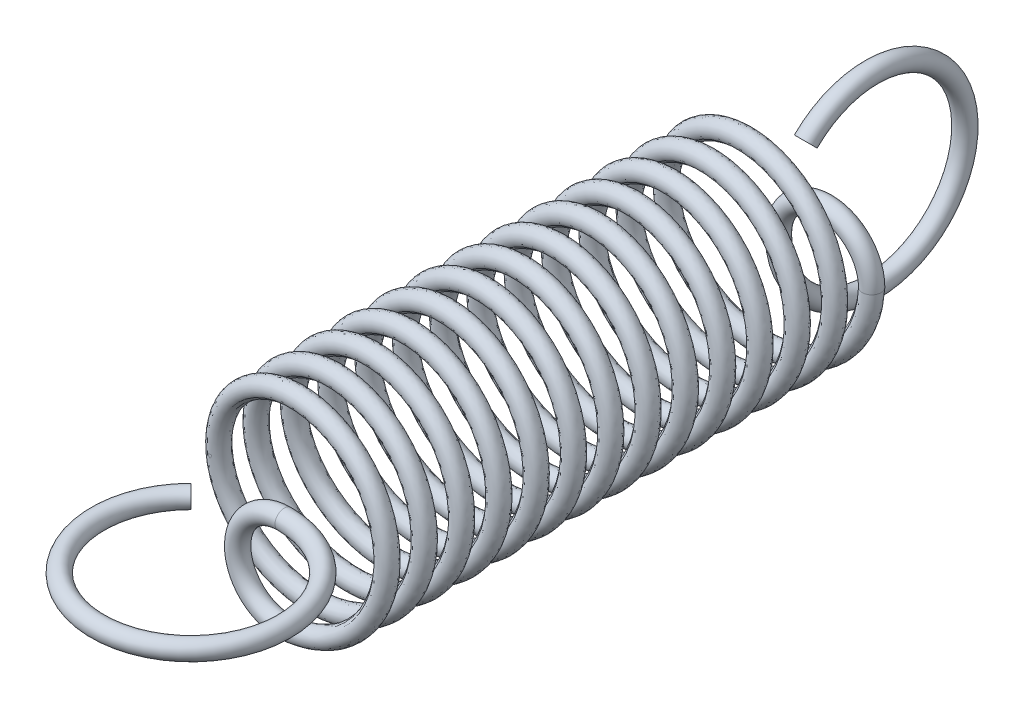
ISO-10303-21;
HEADER;
FILE_DESCRIPTION(('STEP AP214'),'2;1');
FILE_NAME('part.step','',(''),(''),'','','');
FILE_SCHEMA(('AUTOMOTIVE_DESIGN { 1 0 10303 214 1 1 1 1 }'));
ENDSEC;
DATA;
#1=APPLICATION_CONTEXT('core data for automotive mechanical design processes');
#2=APPLICATION_PROTOCOL_DEFINITION('international standard','automotive_design',2000,#1);
#3=PRODUCT_CONTEXT('',#1,'mechanical');
#4=PRODUCT('Part','Part','',(#3));
#5=PRODUCT_RELATED_PRODUCT_CATEGORY('part','',(#4));
#6=PRODUCT_DEFINITION_FORMATION('','',#4);
#7=PRODUCT_DEFINITION_CONTEXT('part definition',#1,'design');
#8=PRODUCT_DEFINITION('design','',#6,#7);
#9=PRODUCT_DEFINITION_SHAPE('','',#8);
#10=(LENGTH_UNIT() NAMED_UNIT(*) SI_UNIT(.MILLI.,.METRE.));
#11=(NAMED_UNIT(*) PLANE_ANGLE_UNIT() SI_UNIT($,.RADIAN.));
#12=(NAMED_UNIT(*) SI_UNIT($,.STERADIAN.) SOLID_ANGLE_UNIT());
#13=UNCERTAINTY_MEASURE_WITH_UNIT(LENGTH_MEASURE(1.E-05),#10,'distance_accuracy_value','');
#14=(GEOMETRIC_REPRESENTATION_CONTEXT(3) GLOBAL_UNCERTAINTY_ASSIGNED_CONTEXT((#13)) GLOBAL_UNIT_ASSIGNED_CONTEXT((#10,
#11,#12)) REPRESENTATION_CONTEXT('',''));
#15=CARTESIAN_POINT('',(0.,0.,0.));
#16=DIRECTION('',(0.,0.,1.));
#17=DIRECTION('',(1.,0.,0.));
#18=AXIS2_PLACEMENT_3D('',#15,#16,#17);
#19=CARTESIAN_POINT('',(4.99999999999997,0.,0.500000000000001));
#20=CARTESIAN_POINT('',(4.99999999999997,-2.88675134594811,0.666666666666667));
#21=CARTESIAN_POINT('',(2.49999999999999,-4.33012701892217,0.833333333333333));
#22=CARTESIAN_POINT('',(0.,-5.77350269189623,1.));
#23=CARTESIAN_POINT('',(-2.49999999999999,-4.33012701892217,1.16666666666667));
#24=CARTESIAN_POINT('',(-4.99999999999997,-2.88675134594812,1.33333333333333));
#25=CARTESIAN_POINT('',(-4.99999999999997,0.,1.5));
#26=CARTESIAN_POINT('',(-4.99999999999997,2.88675134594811,1.66666666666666));
#27=CARTESIAN_POINT('',(-2.49999999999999,4.33012701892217,1.83333333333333));
#28=CARTESIAN_POINT('',(0.,5.77350269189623,2.));
#29=CARTESIAN_POINT('',(2.49999999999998,4.33012701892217,2.16666666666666));
#30=CARTESIAN_POINT('',(4.99999999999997,2.88675134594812,2.33333333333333));
#31=CARTESIAN_POINT('',(4.99999999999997,0.,2.5));
#32=CARTESIAN_POINT('',(4.99999999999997,-2.88675134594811,2.66666666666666));
#33=CARTESIAN_POINT('',(2.49999999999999,-4.33012701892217,2.83333333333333));
#34=CARTESIAN_POINT('',(0.,-5.77350269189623,3.));
#35=CARTESIAN_POINT('',(-2.49999999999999,-4.33012701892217,3.16666666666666));
#36=CARTESIAN_POINT('',(-4.99999999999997,-2.88675134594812,3.33333333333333));
#37=CARTESIAN_POINT('',(-4.99999999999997,0.,3.49999999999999));
#38=CARTESIAN_POINT('',(-4.99999999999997,2.88675134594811,3.66666666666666));
#39=CARTESIAN_POINT('',(-2.49999999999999,4.33012701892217,3.83333333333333));
#40=CARTESIAN_POINT('',(0.,5.77350269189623,3.99999999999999));
#41=CARTESIAN_POINT('',(2.49999999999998,4.33012701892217,4.16666666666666));
#42=CARTESIAN_POINT('',(4.99999999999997,2.88675134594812,4.33333333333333));
#43=CARTESIAN_POINT('',(4.99999999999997,0.,4.49999999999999));
#44=CARTESIAN_POINT('',(4.99999999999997,-2.88675134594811,4.66666666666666));
#45=CARTESIAN_POINT('',(2.49999999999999,-4.33012701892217,4.83333333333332));
#46=CARTESIAN_POINT('',(0.,-5.77350269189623,4.99999999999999));
#47=CARTESIAN_POINT('',(-2.49999999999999,-4.33012701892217,5.16666666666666));
#48=CARTESIAN_POINT('',(-4.99999999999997,-2.88675134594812,5.33333333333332));
#49=CARTESIAN_POINT('',(-4.99999999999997,0.,5.49999999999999));
#50=CARTESIAN_POINT('',(-4.99999999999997,2.88675134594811,5.66666666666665));
#51=CARTESIAN_POINT('',(-2.49999999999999,4.33012701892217,5.83333333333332));
#52=CARTESIAN_POINT('',(0.,5.77350269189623,5.99999999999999));
#53=CARTESIAN_POINT('',(2.49999999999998,4.33012701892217,6.16666666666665));
#54=CARTESIAN_POINT('',(4.99999999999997,2.88675134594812,6.33333333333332));
#55=CARTESIAN_POINT('',(4.99999999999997,0.,6.49999999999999));
#56=CARTESIAN_POINT('',(4.99999999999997,-2.88675134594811,6.66666666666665));
#57=CARTESIAN_POINT('',(2.49999999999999,-4.33012701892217,6.83333333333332));
#58=CARTESIAN_POINT('',(0.,-5.77350269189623,6.99999999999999));
#59=CARTESIAN_POINT('',(-2.49999999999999,-4.33012701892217,7.16666666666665));
#60=CARTESIAN_POINT('',(-4.99999999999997,-2.88675134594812,7.33333333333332));
#61=CARTESIAN_POINT('',(-4.99999999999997,0.,7.49999999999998));
#62=CARTESIAN_POINT('',(-4.99999999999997,2.88675134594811,7.66666666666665));
#63=CARTESIAN_POINT('',(-2.49999999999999,4.33012701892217,7.83333333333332));
#64=CARTESIAN_POINT('',(0.,5.77350269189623,7.99999999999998));
#65=CARTESIAN_POINT('',(2.49999999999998,4.33012701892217,8.16666666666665));
#66=CARTESIAN_POINT('',(4.99999999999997,2.88675134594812,8.33333333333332));
#67=CARTESIAN_POINT('',(4.99999999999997,0.,8.49999999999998));
#68=CARTESIAN_POINT('',(4.99999999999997,-2.88675134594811,8.66666666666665));
#69=CARTESIAN_POINT('',(2.49999999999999,-4.33012701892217,8.83333333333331));
#70=CARTESIAN_POINT('',(0.,-5.77350269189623,8.99999999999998));
#71=CARTESIAN_POINT('',(-2.49999999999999,-4.33012701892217,9.16666666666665));
#72=CARTESIAN_POINT('',(-4.99999999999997,-2.88675134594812,9.33333333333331));
#73=CARTESIAN_POINT('',(-4.99999999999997,0.,9.49999999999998));
#74=CARTESIAN_POINT('',(-4.99999999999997,2.88675134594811,9.66666666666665));
#75=CARTESIAN_POINT('',(-2.49999999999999,4.33012701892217,9.83333333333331));
#76=CARTESIAN_POINT('',(0.,5.77350269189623,9.99999999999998));
#77=CARTESIAN_POINT('',(2.49999999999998,4.33012701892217,10.1666666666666));
#78=CARTESIAN_POINT('',(4.99999999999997,2.88675134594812,10.3333333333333));
#79=CARTESIAN_POINT('',(4.99999999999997,0.,10.5));
#80=CARTESIAN_POINT('',(4.99999999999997,-2.88675134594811,10.6666666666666));
#81=CARTESIAN_POINT('',(2.49999999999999,-4.33012701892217,10.8333333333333));
#82=CARTESIAN_POINT('',(0.,-5.77350269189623,11.));
#83=CARTESIAN_POINT('',(-2.49999999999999,-4.33012701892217,11.1666666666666));
#84=CARTESIAN_POINT('',(-4.99999999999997,-2.88675134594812,11.3333333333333));
#85=CARTESIAN_POINT('',(-4.99999999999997,0.,11.5));
#86=CARTESIAN_POINT('',(-4.99999999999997,2.88675134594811,11.6666666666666));
#87=CARTESIAN_POINT('',(-2.49999999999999,4.33012701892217,11.8333333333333));
#88=CARTESIAN_POINT('',(0.,5.77350269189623,12.));
#89=CARTESIAN_POINT('',(2.49999999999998,4.33012701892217,12.1666666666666));
#90=CARTESIAN_POINT('',(4.99999999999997,2.88675134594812,12.3333333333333));
#91=CARTESIAN_POINT('',(4.99999999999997,0.,12.5));
#92=CARTESIAN_POINT('',(4.99999999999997,-2.88675134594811,12.6666666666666));
#93=CARTESIAN_POINT('',(2.49999999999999,-4.33012701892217,12.8333333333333));
#94=CARTESIAN_POINT('',(0.,-5.77350269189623,13.));
#95=CARTESIAN_POINT('',(-2.49999999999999,-4.33012701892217,13.1666666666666));
#96=CARTESIAN_POINT('',(-4.99999999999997,-2.88675134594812,13.3333333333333));
#97=CARTESIAN_POINT('',(-4.99999999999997,0.,13.5));
#98=CARTESIAN_POINT('',(-4.99999999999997,2.88675134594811,13.6666666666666));
#99=CARTESIAN_POINT('',(-2.49999999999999,4.33012701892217,13.8333333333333));
#100=CARTESIAN_POINT('',(0.,5.77350269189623,14.));
#101=CARTESIAN_POINT('',(2.49999999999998,4.33012701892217,14.1666666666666));
#102=CARTESIAN_POINT('',(4.99999999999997,2.88675134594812,14.3333333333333));
#103=CARTESIAN_POINT('',(4.99999999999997,0.,14.5));
#104=CARTESIAN_POINT('',(4.99999999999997,-2.88675134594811,14.6666666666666));
#105=CARTESIAN_POINT('',(2.49999999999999,-4.33012701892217,14.8333333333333));
#106=CARTESIAN_POINT('',(0.,-5.77350269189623,15.));
#107=CARTESIAN_POINT('',(-2.49999999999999,-4.33012701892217,15.1666666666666));
#108=CARTESIAN_POINT('',(-4.99999999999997,-2.88675134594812,15.3333333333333));
#109=CARTESIAN_POINT('',(-4.99999999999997,0.,15.5));
#110=CARTESIAN_POINT('',(-4.99999999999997,2.88675134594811,15.6666666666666));
#111=CARTESIAN_POINT('',(-2.49999999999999,4.33012701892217,15.8333333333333));
#112=CARTESIAN_POINT('',(0.,5.77350269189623,16.));
#113=CARTESIAN_POINT('',(2.49999999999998,4.33012701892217,16.1666666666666));
#114=CARTESIAN_POINT('',(4.99999999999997,2.88675134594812,16.3333333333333));
#115=CARTESIAN_POINT('',(4.99999999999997,0.,16.5));
#116=CARTESIAN_POINT('',(4.99999999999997,-2.88675134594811,16.6666666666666));
#117=CARTESIAN_POINT('',(2.49999999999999,-4.33012701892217,16.8333333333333));
#118=CARTESIAN_POINT('',(0.,-5.77350269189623,17.));
#119=CARTESIAN_POINT('',(-2.49999999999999,-4.33012701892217,17.1666666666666));
#120=CARTESIAN_POINT('',(-4.99999999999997,-2.88675134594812,17.3333333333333));
#121=CARTESIAN_POINT('',(-4.99999999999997,0.,17.5));
#122=CARTESIAN_POINT('',(-4.99999999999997,2.88675134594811,17.6666666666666));
#123=CARTESIAN_POINT('',(-2.49999999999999,4.33012701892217,17.8333333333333));
#124=CARTESIAN_POINT('',(0.,5.77350269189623,18.));
#125=CARTESIAN_POINT('',(2.49999999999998,4.33012701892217,18.1666666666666));
#126=CARTESIAN_POINT('',(4.99999999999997,2.88675134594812,18.3333333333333));
#127=CARTESIAN_POINT('',(4.99999999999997,0.,18.5));
#128=CARTESIAN_POINT('',(4.99999999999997,-2.88675134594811,18.6666666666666));
#129=CARTESIAN_POINT('',(2.49999999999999,-4.33012701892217,18.8333333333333));
#130=CARTESIAN_POINT('',(0.,-5.77350269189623,19.));
#131=CARTESIAN_POINT('',(-2.49999999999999,-4.33012701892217,19.1666666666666));
#132=CARTESIAN_POINT('',(-4.99999999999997,-2.88675134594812,19.3333333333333));
#133=CARTESIAN_POINT('',(-4.99999999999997,0.,19.5));
#134=CARTESIAN_POINT('',(-4.99999999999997,2.88675134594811,19.6666666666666));
#135=CARTESIAN_POINT('',(-2.49999999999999,4.33012701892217,19.8333333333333));
#136=CARTESIAN_POINT('',(0.,5.77350269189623,20.));
#137=CARTESIAN_POINT('',(2.49999999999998,4.33012701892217,20.1666666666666));
#138=CARTESIAN_POINT('',(4.99999999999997,2.88675134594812,20.3333333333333));
#139=CARTESIAN_POINT('',(4.99999999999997,0.,20.5));
#140=CARTESIAN_POINT('',(4.99999999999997,-2.88675134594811,20.6666666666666));
#141=CARTESIAN_POINT('',(2.49999999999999,-4.33012701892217,20.8333333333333));
#142=CARTESIAN_POINT('',(0.,-5.77350269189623,21.));
#143=CARTESIAN_POINT('',(-2.49999999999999,-4.33012701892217,21.1666666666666));
#144=CARTESIAN_POINT('',(-4.99999999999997,-2.88675134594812,21.3333333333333));
#145=CARTESIAN_POINT('',(-4.99999999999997,0.,21.5));
#146=CARTESIAN_POINT('',(-4.99999999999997,2.88675134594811,21.6666666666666));
#147=CARTESIAN_POINT('',(-2.49999999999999,4.33012701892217,21.8333333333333));
#148=CARTESIAN_POINT('',(0.,5.77350269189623,22.));
#149=CARTESIAN_POINT('',(2.49999999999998,4.33012701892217,22.1666666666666));
#150=CARTESIAN_POINT('',(4.99999999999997,2.88675134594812,22.3333333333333));
#151=CARTESIAN_POINT('',(4.99999999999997,0.,22.5));
#152=CARTESIAN_POINT('',(4.99999999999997,-2.88675134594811,22.6666666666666));
#153=CARTESIAN_POINT('',(2.49999999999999,-4.33012701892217,22.8333333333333));
#154=CARTESIAN_POINT('',(0.,-5.77350269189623,22.9999999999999));
#155=CARTESIAN_POINT('',(-2.49999999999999,-4.33012701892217,23.1666666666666));
#156=CARTESIAN_POINT('',(-4.99999999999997,-2.88675134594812,23.3333333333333));
#157=CARTESIAN_POINT('',(-4.99999999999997,0.,23.4999999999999));
#158=CARTESIAN_POINT('',(-4.99999999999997,2.88675134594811,23.6666666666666));
#159=CARTESIAN_POINT('',(-2.49999999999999,4.33012701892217,23.8333333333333));
#160=CARTESIAN_POINT('',(0.,5.77350269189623,23.9999999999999));
#161=CARTESIAN_POINT('',(2.49999999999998,4.33012701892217,24.1666666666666));
#162=CARTESIAN_POINT('',(4.99999999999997,2.88675134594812,24.3333333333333));
#163=CARTESIAN_POINT('',(4.99999999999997,0.,24.4999999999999));
#164=CARTESIAN_POINT('',(4.99999999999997,-2.88675134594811,24.6666666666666));
#165=CARTESIAN_POINT('',(2.49999999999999,-4.33012701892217,24.8333333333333));
#166=CARTESIAN_POINT('',(0.,-5.77350269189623,24.9999999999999));
#167=CARTESIAN_POINT('',(-2.49999999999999,-4.33012701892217,25.1666666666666));
#168=CARTESIAN_POINT('',(-4.99999999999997,-2.88675134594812,25.3333333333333));
#169=CARTESIAN_POINT('',(-4.99999999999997,0.,25.4999999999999));
#170=CARTESIAN_POINT('',(-4.99999999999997,2.88675134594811,25.6666666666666));
#171=CARTESIAN_POINT('',(-2.49999999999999,4.33012701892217,25.8333333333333));
#172=CARTESIAN_POINT('',(0.,5.77350269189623,25.9999999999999));
#173=CARTESIAN_POINT('',(2.49999999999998,4.33012701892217,26.1666666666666));
#174=CARTESIAN_POINT('',(4.99999999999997,2.88675134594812,26.3333333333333));
#175=CARTESIAN_POINT('',(4.99999999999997,0.,26.4999999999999));
#176=CARTESIAN_POINT('',(4.99999999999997,-2.88675134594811,26.6666666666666));
#177=CARTESIAN_POINT('',(2.49999999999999,-4.33012701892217,26.8333333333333));
#178=CARTESIAN_POINT('',(0.,-5.77350269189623,26.9999999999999));
#179=CARTESIAN_POINT('',(-2.49999999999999,-4.33012701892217,27.1666666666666));
#180=CARTESIAN_POINT('',(-4.99999999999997,-2.88675134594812,27.3333333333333));
#181=CARTESIAN_POINT('',(-4.99999999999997,0.,27.4999999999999));
#182=CARTESIAN_POINT('',(-4.99999999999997,2.88675134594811,27.6666666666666));
#183=CARTESIAN_POINT('',(-2.49999999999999,4.33012701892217,27.8333333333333));
#184=CARTESIAN_POINT('',(0.,5.77350269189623,27.9999999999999));
#185=CARTESIAN_POINT('',(2.49999999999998,4.33012701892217,28.1666666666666));
#186=CARTESIAN_POINT('',(4.99999999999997,2.88675134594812,28.3333333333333));
#187=CARTESIAN_POINT('',(4.99999999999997,0.,28.4999999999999));
#188=CARTESIAN_POINT('',(5.99999999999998,0.,0.500000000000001));
#189=CARTESIAN_POINT('',(5.99999999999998,-3.46410161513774,0.666666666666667));
#190=CARTESIAN_POINT('',(2.99999999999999,-5.19615242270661,0.833333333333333));
#191=CARTESIAN_POINT('',(0.,-6.92820323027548,1.));
#192=CARTESIAN_POINT('',(-2.99999999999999,-5.19615242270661,1.16666666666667));
#193=CARTESIAN_POINT('',(-5.99999999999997,-3.46410161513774,1.33333333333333));
#194=CARTESIAN_POINT('',(-5.99999999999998,0.,1.5));
#195=CARTESIAN_POINT('',(-5.99999999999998,3.46410161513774,1.66666666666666));
#196=CARTESIAN_POINT('',(-2.99999999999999,5.19615242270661,1.83333333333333));
#197=CARTESIAN_POINT('',(0.,6.92820323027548,2.));
#198=CARTESIAN_POINT('',(2.99999999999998,5.19615242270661,2.16666666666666));
#199=CARTESIAN_POINT('',(5.99999999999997,3.46410161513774,2.33333333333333));
#200=CARTESIAN_POINT('',(5.99999999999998,0.,2.5));
#201=CARTESIAN_POINT('',(5.99999999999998,-3.46410161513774,2.66666666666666));
#202=CARTESIAN_POINT('',(2.99999999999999,-5.19615242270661,2.83333333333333));
#203=CARTESIAN_POINT('',(0.,-6.92820323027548,3.));
#204=CARTESIAN_POINT('',(-2.99999999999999,-5.19615242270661,3.16666666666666));
#205=CARTESIAN_POINT('',(-5.99999999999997,-3.46410161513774,3.33333333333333));
#206=CARTESIAN_POINT('',(-5.99999999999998,0.,3.49999999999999));
#207=CARTESIAN_POINT('',(-5.99999999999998,3.46410161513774,3.66666666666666));
#208=CARTESIAN_POINT('',(-2.99999999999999,5.19615242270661,3.83333333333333));
#209=CARTESIAN_POINT('',(0.,6.92820323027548,3.99999999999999));
#210=CARTESIAN_POINT('',(2.99999999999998,5.19615242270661,4.16666666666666));
#211=CARTESIAN_POINT('',(5.99999999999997,3.46410161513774,4.33333333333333));
#212=CARTESIAN_POINT('',(5.99999999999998,0.,4.49999999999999));
#213=CARTESIAN_POINT('',(5.99999999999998,-3.46410161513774,4.66666666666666));
#214=CARTESIAN_POINT('',(2.99999999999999,-5.19615242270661,4.83333333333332));
#215=CARTESIAN_POINT('',(0.,-6.92820323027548,4.99999999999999));
#216=CARTESIAN_POINT('',(-2.99999999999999,-5.19615242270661,5.16666666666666));
#217=CARTESIAN_POINT('',(-5.99999999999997,-3.46410161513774,5.33333333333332));
#218=CARTESIAN_POINT('',(-5.99999999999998,0.,5.49999999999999));
#219=CARTESIAN_POINT('',(-5.99999999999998,3.46410161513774,5.66666666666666));
#220=CARTESIAN_POINT('',(-2.99999999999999,5.19615242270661,5.83333333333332));
#221=CARTESIAN_POINT('',(0.,6.92820323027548,5.99999999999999));
#222=CARTESIAN_POINT('',(2.99999999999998,5.19615242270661,6.16666666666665));
#223=CARTESIAN_POINT('',(5.99999999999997,3.46410161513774,6.33333333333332));
#224=CARTESIAN_POINT('',(5.99999999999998,0.,6.49999999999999));
#225=CARTESIAN_POINT('',(5.99999999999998,-3.46410161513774,6.66666666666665));
#226=CARTESIAN_POINT('',(2.99999999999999,-5.19615242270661,6.83333333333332));
#227=CARTESIAN_POINT('',(0.,-6.92820323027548,6.99999999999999));
#228=CARTESIAN_POINT('',(-2.99999999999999,-5.19615242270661,7.16666666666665));
#229=CARTESIAN_POINT('',(-5.99999999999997,-3.46410161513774,7.33333333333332));
#230=CARTESIAN_POINT('',(-5.99999999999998,0.,7.49999999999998));
#231=CARTESIAN_POINT('',(-5.99999999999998,3.46410161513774,7.66666666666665));
#232=CARTESIAN_POINT('',(-2.99999999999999,5.19615242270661,7.83333333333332));
#233=CARTESIAN_POINT('',(0.,6.92820323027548,7.99999999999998));
#234=CARTESIAN_POINT('',(2.99999999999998,5.19615242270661,8.16666666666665));
#235=CARTESIAN_POINT('',(5.99999999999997,3.46410161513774,8.33333333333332));
#236=CARTESIAN_POINT('',(5.99999999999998,0.,8.49999999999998));
#237=CARTESIAN_POINT('',(5.99999999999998,-3.46410161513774,8.66666666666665));
#238=CARTESIAN_POINT('',(2.99999999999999,-5.19615242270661,8.83333333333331));
#239=CARTESIAN_POINT('',(0.,-6.92820323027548,8.99999999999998));
#240=CARTESIAN_POINT('',(-2.99999999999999,-5.19615242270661,9.16666666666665));
#241=CARTESIAN_POINT('',(-5.99999999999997,-3.46410161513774,9.33333333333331));
#242=CARTESIAN_POINT('',(-5.99999999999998,0.,9.49999999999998));
#243=CARTESIAN_POINT('',(-5.99999999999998,3.46410161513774,9.66666666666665));
#244=CARTESIAN_POINT('',(-2.99999999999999,5.19615242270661,9.83333333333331));
#245=CARTESIAN_POINT('',(0.,6.92820323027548,9.99999999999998));
#246=CARTESIAN_POINT('',(2.99999999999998,5.19615242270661,10.1666666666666));
#247=CARTESIAN_POINT('',(5.99999999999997,3.46410161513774,10.3333333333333));
#248=CARTESIAN_POINT('',(5.99999999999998,0.,10.5));
#249=CARTESIAN_POINT('',(5.99999999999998,-3.46410161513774,10.6666666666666));
#250=CARTESIAN_POINT('',(2.99999999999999,-5.19615242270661,10.8333333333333));
#251=CARTESIAN_POINT('',(0.,-6.92820323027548,11.));
#252=CARTESIAN_POINT('',(-2.99999999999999,-5.19615242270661,11.1666666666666));
#253=CARTESIAN_POINT('',(-5.99999999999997,-3.46410161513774,11.3333333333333));
#254=CARTESIAN_POINT('',(-5.99999999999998,0.,11.5));
#255=CARTESIAN_POINT('',(-5.99999999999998,3.46410161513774,11.6666666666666));
#256=CARTESIAN_POINT('',(-2.99999999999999,5.19615242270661,11.8333333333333));
#257=CARTESIAN_POINT('',(0.,6.92820323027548,12.));
#258=CARTESIAN_POINT('',(2.99999999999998,5.19615242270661,12.1666666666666));
#259=CARTESIAN_POINT('',(5.99999999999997,3.46410161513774,12.3333333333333));
#260=CARTESIAN_POINT('',(5.99999999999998,0.,12.5));
#261=CARTESIAN_POINT('',(5.99999999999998,-3.46410161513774,12.6666666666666));
#262=CARTESIAN_POINT('',(2.99999999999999,-5.19615242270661,12.8333333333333));
#263=CARTESIAN_POINT('',(0.,-6.92820323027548,13.));
#264=CARTESIAN_POINT('',(-2.99999999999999,-5.19615242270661,13.1666666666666));
#265=CARTESIAN_POINT('',(-5.99999999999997,-3.46410161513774,13.3333333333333));
#266=CARTESIAN_POINT('',(-5.99999999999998,0.,13.5));
#267=CARTESIAN_POINT('',(-5.99999999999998,3.46410161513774,13.6666666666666));
#268=CARTESIAN_POINT('',(-2.99999999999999,5.19615242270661,13.8333333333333));
#269=CARTESIAN_POINT('',(0.,6.92820323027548,14.));
#270=CARTESIAN_POINT('',(2.99999999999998,5.19615242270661,14.1666666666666));
#271=CARTESIAN_POINT('',(5.99999999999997,3.46410161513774,14.3333333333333));
#272=CARTESIAN_POINT('',(5.99999999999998,0.,14.5));
#273=CARTESIAN_POINT('',(5.99999999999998,-3.46410161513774,14.6666666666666));
#274=CARTESIAN_POINT('',(2.99999999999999,-5.19615242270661,14.8333333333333));
#275=CARTESIAN_POINT('',(0.,-6.92820323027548,15.));
#276=CARTESIAN_POINT('',(-2.99999999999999,-5.19615242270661,15.1666666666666));
#277=CARTESIAN_POINT('',(-5.99999999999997,-3.46410161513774,15.3333333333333));
#278=CARTESIAN_POINT('',(-5.99999999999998,0.,15.5));
#279=CARTESIAN_POINT('',(-5.99999999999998,3.46410161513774,15.6666666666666));
#280=CARTESIAN_POINT('',(-2.99999999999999,5.19615242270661,15.8333333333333));
#281=CARTESIAN_POINT('',(0.,6.92820323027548,16.));
#282=CARTESIAN_POINT('',(2.99999999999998,5.19615242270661,16.1666666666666));
#283=CARTESIAN_POINT('',(5.99999999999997,3.46410161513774,16.3333333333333));
#284=CARTESIAN_POINT('',(5.99999999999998,0.,16.5));
#285=CARTESIAN_POINT('',(5.99999999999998,-3.46410161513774,16.6666666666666));
#286=CARTESIAN_POINT('',(2.99999999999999,-5.19615242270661,16.8333333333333));
#287=CARTESIAN_POINT('',(0.,-6.92820323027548,17.));
#288=CARTESIAN_POINT('',(-2.99999999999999,-5.19615242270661,17.1666666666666));
#289=CARTESIAN_POINT('',(-5.99999999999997,-3.46410161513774,17.3333333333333));
#290=CARTESIAN_POINT('',(-5.99999999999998,0.,17.5));
#291=CARTESIAN_POINT('',(-5.99999999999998,3.46410161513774,17.6666666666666));
#292=CARTESIAN_POINT('',(-2.99999999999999,5.19615242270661,17.8333333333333));
#293=CARTESIAN_POINT('',(0.,6.92820323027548,18.));
#294=CARTESIAN_POINT('',(2.99999999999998,5.19615242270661,18.1666666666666));
#295=CARTESIAN_POINT('',(5.99999999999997,3.46410161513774,18.3333333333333));
#296=CARTESIAN_POINT('',(5.99999999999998,0.,18.5));
#297=CARTESIAN_POINT('',(5.99999999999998,-3.46410161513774,18.6666666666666));
#298=CARTESIAN_POINT('',(2.99999999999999,-5.19615242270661,18.8333333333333));
#299=CARTESIAN_POINT('',(0.,-6.92820323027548,19.));
#300=CARTESIAN_POINT('',(-2.99999999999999,-5.19615242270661,19.1666666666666));
#301=CARTESIAN_POINT('',(-5.99999999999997,-3.46410161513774,19.3333333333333));
#302=CARTESIAN_POINT('',(-5.99999999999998,0.,19.5));
#303=CARTESIAN_POINT('',(-5.99999999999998,3.46410161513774,19.6666666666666));
#304=CARTESIAN_POINT('',(-2.99999999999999,5.19615242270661,19.8333333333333));
#305=CARTESIAN_POINT('',(0.,6.92820323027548,20.));
#306=CARTESIAN_POINT('',(2.99999999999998,5.19615242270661,20.1666666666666));
#307=CARTESIAN_POINT('',(5.99999999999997,3.46410161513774,20.3333333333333));
#308=CARTESIAN_POINT('',(5.99999999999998,0.,20.5));
#309=CARTESIAN_POINT('',(5.99999999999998,-3.46410161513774,20.6666666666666));
#310=CARTESIAN_POINT('',(2.99999999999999,-5.19615242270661,20.8333333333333));
#311=CARTESIAN_POINT('',(0.,-6.92820323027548,21.));
#312=CARTESIAN_POINT('',(-2.99999999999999,-5.19615242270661,21.1666666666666));
#313=CARTESIAN_POINT('',(-5.99999999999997,-3.46410161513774,21.3333333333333));
#314=CARTESIAN_POINT('',(-5.99999999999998,0.,21.5));
#315=CARTESIAN_POINT('',(-5.99999999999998,3.46410161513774,21.6666666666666));
#316=CARTESIAN_POINT('',(-2.99999999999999,5.19615242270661,21.8333333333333));
#317=CARTESIAN_POINT('',(0.,6.92820323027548,22.));
#318=CARTESIAN_POINT('',(2.99999999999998,5.19615242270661,22.1666666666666));
#319=CARTESIAN_POINT('',(5.99999999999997,3.46410161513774,22.3333333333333));
#320=CARTESIAN_POINT('',(5.99999999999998,0.,22.5));
#321=CARTESIAN_POINT('',(5.99999999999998,-3.46410161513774,22.6666666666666));
#322=CARTESIAN_POINT('',(2.99999999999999,-5.19615242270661,22.8333333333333));
#323=CARTESIAN_POINT('',(0.,-6.92820323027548,22.9999999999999));
#324=CARTESIAN_POINT('',(-2.99999999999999,-5.19615242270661,23.1666666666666));
#325=CARTESIAN_POINT('',(-5.99999999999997,-3.46410161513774,23.3333333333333));
#326=CARTESIAN_POINT('',(-5.99999999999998,0.,23.4999999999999));
#327=CARTESIAN_POINT('',(-5.99999999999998,3.46410161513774,23.6666666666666));
#328=CARTESIAN_POINT('',(-2.99999999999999,5.19615242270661,23.8333333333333));
#329=CARTESIAN_POINT('',(0.,6.92820323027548,23.9999999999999));
#330=CARTESIAN_POINT('',(2.99999999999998,5.19615242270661,24.1666666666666));
#331=CARTESIAN_POINT('',(5.99999999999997,3.46410161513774,24.3333333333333));
#332=CARTESIAN_POINT('',(5.99999999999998,0.,24.5));
#333=CARTESIAN_POINT('',(5.99999999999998,-3.46410161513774,24.6666666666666));
#334=CARTESIAN_POINT('',(2.99999999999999,-5.19615242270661,24.8333333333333));
#335=CARTESIAN_POINT('',(0.,-6.92820323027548,24.9999999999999));
#336=CARTESIAN_POINT('',(-2.99999999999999,-5.19615242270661,25.1666666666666));
#337=CARTESIAN_POINT('',(-5.99999999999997,-3.46410161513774,25.3333333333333));
#338=CARTESIAN_POINT('',(-5.99999999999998,0.,25.4999999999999));
#339=CARTESIAN_POINT('',(-5.99999999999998,3.46410161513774,25.6666666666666));
#340=CARTESIAN_POINT('',(-2.99999999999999,5.19615242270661,25.8333333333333));
#341=CARTESIAN_POINT('',(0.,6.92820323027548,25.9999999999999));
#342=CARTESIAN_POINT('',(2.99999999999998,5.19615242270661,26.1666666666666));
#343=CARTESIAN_POINT('',(5.99999999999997,3.46410161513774,26.3333333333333));
#344=CARTESIAN_POINT('',(5.99999999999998,0.,26.4999999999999));
#345=CARTESIAN_POINT('',(5.99999999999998,-3.46410161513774,26.6666666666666));
#346=CARTESIAN_POINT('',(2.99999999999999,-5.19615242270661,26.8333333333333));
#347=CARTESIAN_POINT('',(0.,-6.92820323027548,26.9999999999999));
#348=CARTESIAN_POINT('',(-2.99999999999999,-5.19615242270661,27.1666666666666));
#349=CARTESIAN_POINT('',(-5.99999999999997,-3.46410161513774,27.3333333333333));
#350=CARTESIAN_POINT('',(-5.99999999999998,0.,27.4999999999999));
#351=CARTESIAN_POINT('',(-5.99999999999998,3.46410161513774,27.6666666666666));
#352=CARTESIAN_POINT('',(-2.99999999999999,5.19615242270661,27.8333333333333));
#353=CARTESIAN_POINT('',(0.,6.92820323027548,27.9999999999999));
#354=CARTESIAN_POINT('',(2.99999999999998,5.19615242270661,28.1666666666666));
#355=CARTESIAN_POINT('',(5.99999999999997,3.46410161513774,28.3333333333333));
#356=CARTESIAN_POINT('',(5.99999999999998,0.,28.4999999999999));
#357=CARTESIAN_POINT('',(5.99999999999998,0.,-0.500000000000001));
#358=CARTESIAN_POINT('',(5.99999999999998,-3.46410161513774,-0.333333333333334));
#359=CARTESIAN_POINT('',(2.99999999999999,-5.19615242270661,-0.166666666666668));
#360=CARTESIAN_POINT('',(0.,-6.92820323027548,0.));
#361=CARTESIAN_POINT('',(-2.99999999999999,-5.19615242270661,0.166666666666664));
#362=CARTESIAN_POINT('',(-5.99999999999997,-3.46410161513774,0.333333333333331));
#363=CARTESIAN_POINT('',(-5.99999999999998,0.,0.499999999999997));
#364=CARTESIAN_POINT('',(-5.99999999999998,3.46410161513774,0.666666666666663));
#365=CARTESIAN_POINT('',(-2.99999999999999,5.19615242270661,0.83333333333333));
#366=CARTESIAN_POINT('',(0.,6.92820323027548,0.999999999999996));
#367=CARTESIAN_POINT('',(2.99999999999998,5.19615242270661,1.16666666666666));
#368=CARTESIAN_POINT('',(5.99999999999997,3.46410161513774,1.33333333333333));
#369=CARTESIAN_POINT('',(5.99999999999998,0.,1.49999999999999));
#370=CARTESIAN_POINT('',(5.99999999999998,-3.46410161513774,1.66666666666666));
#371=CARTESIAN_POINT('',(2.99999999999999,-5.19615242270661,1.83333333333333));
#372=CARTESIAN_POINT('',(0.,-6.92820323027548,1.99999999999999));
#373=CARTESIAN_POINT('',(-2.99999999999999,-5.19615242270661,2.16666666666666));
#374=CARTESIAN_POINT('',(-5.99999999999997,-3.46410161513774,2.33333333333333));
#375=CARTESIAN_POINT('',(-5.99999999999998,0.,2.49999999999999));
#376=CARTESIAN_POINT('',(-5.99999999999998,3.46410161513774,2.66666666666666));
#377=CARTESIAN_POINT('',(-2.99999999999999,5.19615242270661,2.83333333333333));
#378=CARTESIAN_POINT('',(0.,6.92820323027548,2.99999999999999));
#379=CARTESIAN_POINT('',(2.99999999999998,5.19615242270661,3.16666666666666));
#380=CARTESIAN_POINT('',(5.99999999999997,3.46410161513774,3.33333333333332));
#381=CARTESIAN_POINT('',(5.99999999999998,0.,3.49999999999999));
#382=CARTESIAN_POINT('',(5.99999999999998,-3.46410161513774,3.66666666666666));
#383=CARTESIAN_POINT('',(2.99999999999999,-5.19615242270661,3.83333333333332));
#384=CARTESIAN_POINT('',(0.,-6.92820323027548,3.99999999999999));
#385=CARTESIAN_POINT('',(-2.99999999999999,-5.19615242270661,4.16666666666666));
#386=CARTESIAN_POINT('',(-5.99999999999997,-3.46410161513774,4.33333333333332));
#387=CARTESIAN_POINT('',(-5.99999999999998,0.,4.49999999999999));
#388=CARTESIAN_POINT('',(-5.99999999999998,3.46410161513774,4.66666666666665));
#389=CARTESIAN_POINT('',(-2.99999999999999,5.19615242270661,4.83333333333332));
#390=CARTESIAN_POINT('',(0.,6.92820323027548,4.99999999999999));
#391=CARTESIAN_POINT('',(2.99999999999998,5.19615242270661,5.16666666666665));
#392=CARTESIAN_POINT('',(5.99999999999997,3.46410161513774,5.33333333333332));
#393=CARTESIAN_POINT('',(5.99999999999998,0.,5.49999999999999));
#394=CARTESIAN_POINT('',(5.99999999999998,-3.46410161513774,5.66666666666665));
#395=CARTESIAN_POINT('',(2.99999999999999,-5.19615242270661,5.83333333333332));
#396=CARTESIAN_POINT('',(0.,-6.92820323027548,5.99999999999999));
#397=CARTESIAN_POINT('',(-2.99999999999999,-5.19615242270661,6.16666666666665));
#398=CARTESIAN_POINT('',(-5.99999999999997,-3.46410161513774,6.33333333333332));
#399=CARTESIAN_POINT('',(-5.99999999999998,0.,6.49999999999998));
#400=CARTESIAN_POINT('',(-5.99999999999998,3.46410161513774,6.66666666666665));
#401=CARTESIAN_POINT('',(-2.99999999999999,5.19615242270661,6.83333333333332));
#402=CARTESIAN_POINT('',(0.,6.92820323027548,6.99999999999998));
#403=CARTESIAN_POINT('',(2.99999999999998,5.19615242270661,7.16666666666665));
#404=CARTESIAN_POINT('',(5.99999999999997,3.46410161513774,7.33333333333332));
#405=CARTESIAN_POINT('',(5.99999999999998,0.,7.49999999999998));
#406=CARTESIAN_POINT('',(5.99999999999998,-3.46410161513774,7.66666666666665));
#407=CARTESIAN_POINT('',(2.99999999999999,-5.19615242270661,7.83333333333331));
#408=CARTESIAN_POINT('',(0.,-6.92820323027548,7.99999999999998));
#409=CARTESIAN_POINT('',(-2.99999999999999,-5.19615242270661,8.16666666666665));
#410=CARTESIAN_POINT('',(-5.99999999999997,-3.46410161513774,8.33333333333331));
#411=CARTESIAN_POINT('',(-5.99999999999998,0.,8.49999999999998));
#412=CARTESIAN_POINT('',(-5.99999999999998,3.46410161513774,8.66666666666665));
#413=CARTESIAN_POINT('',(-2.99999999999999,5.19615242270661,8.83333333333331));
#414=CARTESIAN_POINT('',(0.,6.92820323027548,8.99999999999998));
#415=CARTESIAN_POINT('',(2.99999999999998,5.19615242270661,9.16666666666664));
#416=CARTESIAN_POINT('',(5.99999999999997,3.46410161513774,9.33333333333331));
#417=CARTESIAN_POINT('',(5.99999999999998,0.,9.49999999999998));
#418=CARTESIAN_POINT('',(5.99999999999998,-3.46410161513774,9.66666666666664));
#419=CARTESIAN_POINT('',(2.99999999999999,-5.19615242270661,9.83333333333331));
#420=CARTESIAN_POINT('',(0.,-6.92820323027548,9.99999999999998));
#421=CARTESIAN_POINT('',(-2.99999999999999,-5.19615242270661,10.1666666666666));
#422=CARTESIAN_POINT('',(-5.99999999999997,-3.46410161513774,10.3333333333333));
#423=CARTESIAN_POINT('',(-5.99999999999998,0.,10.5));
#424=CARTESIAN_POINT('',(-5.99999999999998,3.46410161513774,10.6666666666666));
#425=CARTESIAN_POINT('',(-2.99999999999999,5.19615242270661,10.8333333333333));
#426=CARTESIAN_POINT('',(0.,6.92820323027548,11.));
#427=CARTESIAN_POINT('',(2.99999999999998,5.19615242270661,11.1666666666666));
#428=CARTESIAN_POINT('',(5.99999999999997,3.46410161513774,11.3333333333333));
#429=CARTESIAN_POINT('',(5.99999999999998,0.,11.5));
#430=CARTESIAN_POINT('',(5.99999999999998,-3.46410161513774,11.6666666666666));
#431=CARTESIAN_POINT('',(2.99999999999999,-5.19615242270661,11.8333333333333));
#432=CARTESIAN_POINT('',(0.,-6.92820323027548,12.));
#433=CARTESIAN_POINT('',(-2.99999999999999,-5.19615242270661,12.1666666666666));
#434=CARTESIAN_POINT('',(-5.99999999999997,-3.46410161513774,12.3333333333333));
#435=CARTESIAN_POINT('',(-5.99999999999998,0.,12.5));
#436=CARTESIAN_POINT('',(-5.99999999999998,3.46410161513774,12.6666666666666));
#437=CARTESIAN_POINT('',(-2.99999999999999,5.19615242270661,12.8333333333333));
#438=CARTESIAN_POINT('',(0.,6.92820323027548,13.));
#439=CARTESIAN_POINT('',(2.99999999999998,5.19615242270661,13.1666666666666));
#440=CARTESIAN_POINT('',(5.99999999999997,3.46410161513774,13.3333333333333));
#441=CARTESIAN_POINT('',(5.99999999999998,0.,13.5));
#442=CARTESIAN_POINT('',(5.99999999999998,-3.46410161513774,13.6666666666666));
#443=CARTESIAN_POINT('',(2.99999999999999,-5.19615242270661,13.8333333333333));
#444=CARTESIAN_POINT('',(0.,-6.92820323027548,14.));
#445=CARTESIAN_POINT('',(-2.99999999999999,-5.19615242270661,14.1666666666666));
#446=CARTESIAN_POINT('',(-5.99999999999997,-3.46410161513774,14.3333333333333));
#447=CARTESIAN_POINT('',(-5.99999999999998,0.,14.5));
#448=CARTESIAN_POINT('',(-5.99999999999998,3.46410161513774,14.6666666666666));
#449=CARTESIAN_POINT('',(-2.99999999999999,5.19615242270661,14.8333333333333));
#450=CARTESIAN_POINT('',(0.,6.92820323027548,15.));
#451=CARTESIAN_POINT('',(2.99999999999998,5.19615242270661,15.1666666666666));
#452=CARTESIAN_POINT('',(5.99999999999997,3.46410161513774,15.3333333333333));
#453=CARTESIAN_POINT('',(5.99999999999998,0.,15.5));
#454=CARTESIAN_POINT('',(5.99999999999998,-3.46410161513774,15.6666666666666));
#455=CARTESIAN_POINT('',(2.99999999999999,-5.19615242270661,15.8333333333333));
#456=CARTESIAN_POINT('',(0.,-6.92820323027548,16.));
#457=CARTESIAN_POINT('',(-2.99999999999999,-5.19615242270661,16.1666666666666));
#458=CARTESIAN_POINT('',(-5.99999999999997,-3.46410161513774,16.3333333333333));
#459=CARTESIAN_POINT('',(-5.99999999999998,0.,16.5));
#460=CARTESIAN_POINT('',(-5.99999999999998,3.46410161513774,16.6666666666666));
#461=CARTESIAN_POINT('',(-2.99999999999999,5.19615242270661,16.8333333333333));
#462=CARTESIAN_POINT('',(0.,6.92820323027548,17.));
#463=CARTESIAN_POINT('',(2.99999999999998,5.19615242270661,17.1666666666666));
#464=CARTESIAN_POINT('',(5.99999999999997,3.46410161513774,17.3333333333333));
#465=CARTESIAN_POINT('',(5.99999999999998,0.,17.5));
#466=CARTESIAN_POINT('',(5.99999999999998,-3.46410161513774,17.6666666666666));
#467=CARTESIAN_POINT('',(2.99999999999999,-5.19615242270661,17.8333333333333));
#468=CARTESIAN_POINT('',(0.,-6.92820323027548,18.));
#469=CARTESIAN_POINT('',(-2.99999999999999,-5.19615242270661,18.1666666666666));
#470=CARTESIAN_POINT('',(-5.99999999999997,-3.46410161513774,18.3333333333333));
#471=CARTESIAN_POINT('',(-5.99999999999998,0.,18.5));
#472=CARTESIAN_POINT('',(-5.99999999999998,3.46410161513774,18.6666666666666));
#473=CARTESIAN_POINT('',(-2.99999999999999,5.19615242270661,18.8333333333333));
#474=CARTESIAN_POINT('',(0.,6.92820323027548,19.));
#475=CARTESIAN_POINT('',(2.99999999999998,5.19615242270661,19.1666666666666));
#476=CARTESIAN_POINT('',(5.99999999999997,3.46410161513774,19.3333333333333));
#477=CARTESIAN_POINT('',(5.99999999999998,0.,19.5));
#478=CARTESIAN_POINT('',(5.99999999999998,-3.46410161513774,19.6666666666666));
#479=CARTESIAN_POINT('',(2.99999999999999,-5.19615242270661,19.8333333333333));
#480=CARTESIAN_POINT('',(0.,-6.92820323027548,20.));
#481=CARTESIAN_POINT('',(-2.99999999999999,-5.19615242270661,20.1666666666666));
#482=CARTESIAN_POINT('',(-5.99999999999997,-3.46410161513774,20.3333333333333));
#483=CARTESIAN_POINT('',(-5.99999999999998,0.,20.5));
#484=CARTESIAN_POINT('',(-5.99999999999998,3.46410161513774,20.6666666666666));
#485=CARTESIAN_POINT('',(-2.99999999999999,5.19615242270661,20.8333333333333));
#486=CARTESIAN_POINT('',(0.,6.92820323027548,21.));
#487=CARTESIAN_POINT('',(2.99999999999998,5.19615242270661,21.1666666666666));
#488=CARTESIAN_POINT('',(5.99999999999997,3.46410161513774,21.3333333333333));
#489=CARTESIAN_POINT('',(5.99999999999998,0.,21.5));
#490=CARTESIAN_POINT('',(5.99999999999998,-3.46410161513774,21.6666666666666));
#491=CARTESIAN_POINT('',(2.99999999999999,-5.19615242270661,21.8333333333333));
#492=CARTESIAN_POINT('',(0.,-6.92820323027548,22.));
#493=CARTESIAN_POINT('',(-2.99999999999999,-5.19615242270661,22.1666666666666));
#494=CARTESIAN_POINT('',(-5.99999999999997,-3.46410161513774,22.3333333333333));
#495=CARTESIAN_POINT('',(-5.99999999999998,0.,22.4999999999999));
#496=CARTESIAN_POINT('',(-5.99999999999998,3.46410161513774,22.6666666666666));
#497=CARTESIAN_POINT('',(-2.99999999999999,5.19615242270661,22.8333333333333));
#498=CARTESIAN_POINT('',(0.,6.92820323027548,22.9999999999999));
#499=CARTESIAN_POINT('',(2.99999999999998,5.19615242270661,23.1666666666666));
#500=CARTESIAN_POINT('',(5.99999999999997,3.46410161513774,23.3333333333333));
#501=CARTESIAN_POINT('',(5.99999999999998,0.,23.4999999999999));
#502=CARTESIAN_POINT('',(5.99999999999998,-3.46410161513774,23.6666666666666));
#503=CARTESIAN_POINT('',(2.99999999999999,-5.19615242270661,23.8333333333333));
#504=CARTESIAN_POINT('',(0.,-6.92820323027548,23.9999999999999));
#505=CARTESIAN_POINT('',(-2.99999999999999,-5.19615242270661,24.1666666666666));
#506=CARTESIAN_POINT('',(-5.99999999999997,-3.46410161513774,24.3333333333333));
#507=CARTESIAN_POINT('',(-5.99999999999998,0.,24.4999999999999));
#508=CARTESIAN_POINT('',(-5.99999999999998,3.46410161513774,24.6666666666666));
#509=CARTESIAN_POINT('',(-2.99999999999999,5.19615242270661,24.8333333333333));
#510=CARTESIAN_POINT('',(0.,6.92820323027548,24.9999999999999));
#511=CARTESIAN_POINT('',(2.99999999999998,5.19615242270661,25.1666666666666));
#512=CARTESIAN_POINT('',(5.99999999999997,3.46410161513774,25.3333333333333));
#513=CARTESIAN_POINT('',(5.99999999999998,0.,25.4999999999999));
#514=CARTESIAN_POINT('',(5.99999999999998,-3.46410161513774,25.6666666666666));
#515=CARTESIAN_POINT('',(2.99999999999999,-5.19615242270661,25.8333333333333));
#516=CARTESIAN_POINT('',(0.,-6.92820323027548,25.9999999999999));
#517=CARTESIAN_POINT('',(-2.99999999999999,-5.19615242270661,26.1666666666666));
#518=CARTESIAN_POINT('',(-5.99999999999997,-3.46410161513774,26.3333333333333));
#519=CARTESIAN_POINT('',(-5.99999999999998,0.,26.4999999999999));
#520=CARTESIAN_POINT('',(-5.99999999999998,3.46410161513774,26.6666666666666));
#521=CARTESIAN_POINT('',(-2.99999999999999,5.19615242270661,26.8333333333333));
#522=CARTESIAN_POINT('',(0.,6.92820323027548,26.9999999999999));
#523=CARTESIAN_POINT('',(2.99999999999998,5.19615242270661,27.1666666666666));
#524=CARTESIAN_POINT('',(5.99999999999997,3.46410161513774,27.3333333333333));
#525=CARTESIAN_POINT('',(5.99999999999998,0.,27.4999999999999));
#526=CARTESIAN_POINT('',(4.99999999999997,0.,-0.500000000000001));
#527=CARTESIAN_POINT('',(4.99999999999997,-2.88675134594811,-0.333333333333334));
#528=CARTESIAN_POINT('',(2.49999999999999,-4.33012701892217,-0.166666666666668));
#529=CARTESIAN_POINT('',(0.,-5.77350269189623,0.));
#530=CARTESIAN_POINT('',(-2.49999999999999,-4.33012701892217,0.166666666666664));
#531=CARTESIAN_POINT('',(-4.99999999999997,-2.88675134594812,0.333333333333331));
#532=CARTESIAN_POINT('',(-4.99999999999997,0.,0.499999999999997));
#533=CARTESIAN_POINT('',(-4.99999999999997,2.88675134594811,0.666666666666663));
#534=CARTESIAN_POINT('',(-2.49999999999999,4.33012701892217,0.833333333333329));
#535=CARTESIAN_POINT('',(0.,5.77350269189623,0.999999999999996));
#536=CARTESIAN_POINT('',(2.49999999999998,4.33012701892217,1.16666666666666));
#537=CARTESIAN_POINT('',(4.99999999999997,2.88675134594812,1.33333333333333));
#538=CARTESIAN_POINT('',(4.99999999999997,0.,1.49999999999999));
#539=CARTESIAN_POINT('',(4.99999999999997,-2.88675134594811,1.66666666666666));
#540=CARTESIAN_POINT('',(2.49999999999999,-4.33012701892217,1.83333333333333));
#541=CARTESIAN_POINT('',(0.,-5.77350269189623,1.99999999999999));
#542=CARTESIAN_POINT('',(-2.49999999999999,-4.33012701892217,2.16666666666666));
#543=CARTESIAN_POINT('',(-4.99999999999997,-2.88675134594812,2.33333333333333));
#544=CARTESIAN_POINT('',(-4.99999999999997,0.,2.49999999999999));
#545=CARTESIAN_POINT('',(-4.99999999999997,2.88675134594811,2.66666666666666));
#546=CARTESIAN_POINT('',(-2.49999999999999,4.33012701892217,2.83333333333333));
#547=CARTESIAN_POINT('',(0.,5.77350269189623,2.99999999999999));
#548=CARTESIAN_POINT('',(2.49999999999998,4.33012701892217,3.16666666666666));
#549=CARTESIAN_POINT('',(4.99999999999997,2.88675134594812,3.33333333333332));
#550=CARTESIAN_POINT('',(4.99999999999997,0.,3.49999999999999));
#551=CARTESIAN_POINT('',(4.99999999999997,-2.88675134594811,3.66666666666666));
#552=CARTESIAN_POINT('',(2.49999999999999,-4.33012701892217,3.83333333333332));
#553=CARTESIAN_POINT('',(0.,-5.77350269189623,3.99999999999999));
#554=CARTESIAN_POINT('',(-2.49999999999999,-4.33012701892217,4.16666666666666));
#555=CARTESIAN_POINT('',(-4.99999999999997,-2.88675134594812,4.33333333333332));
#556=CARTESIAN_POINT('',(-4.99999999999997,0.,4.49999999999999));
#557=CARTESIAN_POINT('',(-4.99999999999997,2.88675134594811,4.66666666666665));
#558=CARTESIAN_POINT('',(-2.49999999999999,4.33012701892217,4.83333333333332));
#559=CARTESIAN_POINT('',(0.,5.77350269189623,4.99999999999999));
#560=CARTESIAN_POINT('',(2.49999999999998,4.33012701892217,5.16666666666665));
#561=CARTESIAN_POINT('',(4.99999999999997,2.88675134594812,5.33333333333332));
#562=CARTESIAN_POINT('',(4.99999999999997,0.,5.49999999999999));
#563=CARTESIAN_POINT('',(4.99999999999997,-2.88675134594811,5.66666666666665));
#564=CARTESIAN_POINT('',(2.49999999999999,-4.33012701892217,5.83333333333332));
#565=CARTESIAN_POINT('',(0.,-5.77350269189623,5.99999999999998));
#566=CARTESIAN_POINT('',(-2.49999999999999,-4.33012701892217,6.16666666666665));
#567=CARTESIAN_POINT('',(-4.99999999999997,-2.88675134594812,6.33333333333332));
#568=CARTESIAN_POINT('',(-4.99999999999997,0.,6.49999999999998));
#569=CARTESIAN_POINT('',(-4.99999999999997,2.88675134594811,6.66666666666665));
#570=CARTESIAN_POINT('',(-2.49999999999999,4.33012701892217,6.83333333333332));
#571=CARTESIAN_POINT('',(0.,5.77350269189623,6.99999999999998));
#572=CARTESIAN_POINT('',(2.49999999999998,4.33012701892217,7.16666666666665));
#573=CARTESIAN_POINT('',(4.99999999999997,2.88675134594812,7.33333333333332));
#574=CARTESIAN_POINT('',(4.99999999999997,0.,7.49999999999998));
#575=CARTESIAN_POINT('',(4.99999999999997,-2.88675134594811,7.66666666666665));
#576=CARTESIAN_POINT('',(2.49999999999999,-4.33012701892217,7.83333333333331));
#577=CARTESIAN_POINT('',(0.,-5.77350269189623,7.99999999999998));
#578=CARTESIAN_POINT('',(-2.49999999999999,-4.33012701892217,8.16666666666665));
#579=CARTESIAN_POINT('',(-4.99999999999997,-2.88675134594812,8.33333333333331));
#580=CARTESIAN_POINT('',(-4.99999999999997,0.,8.49999999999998));
#581=CARTESIAN_POINT('',(-4.99999999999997,2.88675134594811,8.66666666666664));
#582=CARTESIAN_POINT('',(-2.49999999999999,4.33012701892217,8.83333333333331));
#583=CARTESIAN_POINT('',(0.,5.77350269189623,8.99999999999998));
#584=CARTESIAN_POINT('',(2.49999999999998,4.33012701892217,9.16666666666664));
#585=CARTESIAN_POINT('',(4.99999999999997,2.88675134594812,9.33333333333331));
#586=CARTESIAN_POINT('',(4.99999999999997,0.,9.49999999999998));
#587=CARTESIAN_POINT('',(4.99999999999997,-2.88675134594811,9.66666666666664));
#588=CARTESIAN_POINT('',(2.49999999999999,-4.33012701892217,9.83333333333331));
#589=CARTESIAN_POINT('',(0.,-5.77350269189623,9.99999999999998));
#590=CARTESIAN_POINT('',(-2.49999999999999,-4.33012701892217,10.1666666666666));
#591=CARTESIAN_POINT('',(-4.99999999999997,-2.88675134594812,10.3333333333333));
#592=CARTESIAN_POINT('',(-4.99999999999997,0.,10.5));
#593=CARTESIAN_POINT('',(-4.99999999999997,2.88675134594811,10.6666666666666));
#594=CARTESIAN_POINT('',(-2.49999999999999,4.33012701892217,10.8333333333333));
#595=CARTESIAN_POINT('',(0.,5.77350269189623,11.));
#596=CARTESIAN_POINT('',(2.49999999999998,4.33012701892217,11.1666666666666));
#597=CARTESIAN_POINT('',(4.99999999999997,2.88675134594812,11.3333333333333));
#598=CARTESIAN_POINT('',(4.99999999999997,0.,11.5));
#599=CARTESIAN_POINT('',(4.99999999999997,-2.88675134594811,11.6666666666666));
#600=CARTESIAN_POINT('',(2.49999999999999,-4.33012701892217,11.8333333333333));
#601=CARTESIAN_POINT('',(0.,-5.77350269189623,12.));
#602=CARTESIAN_POINT('',(-2.49999999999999,-4.33012701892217,12.1666666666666));
#603=CARTESIAN_POINT('',(-4.99999999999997,-2.88675134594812,12.3333333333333));
#604=CARTESIAN_POINT('',(-4.99999999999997,0.,12.5));
#605=CARTESIAN_POINT('',(-4.99999999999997,2.88675134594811,12.6666666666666));
#606=CARTESIAN_POINT('',(-2.49999999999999,4.33012701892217,12.8333333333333));
#607=CARTESIAN_POINT('',(0.,5.77350269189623,13.));
#608=CARTESIAN_POINT('',(2.49999999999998,4.33012701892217,13.1666666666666));
#609=CARTESIAN_POINT('',(4.99999999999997,2.88675134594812,13.3333333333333));
#610=CARTESIAN_POINT('',(4.99999999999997,0.,13.5));
#611=CARTESIAN_POINT('',(4.99999999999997,-2.88675134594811,13.6666666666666));
#612=CARTESIAN_POINT('',(2.49999999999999,-4.33012701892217,13.8333333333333));
#613=CARTESIAN_POINT('',(0.,-5.77350269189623,14.));
#614=CARTESIAN_POINT('',(-2.49999999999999,-4.33012701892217,14.1666666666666));
#615=CARTESIAN_POINT('',(-4.99999999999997,-2.88675134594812,14.3333333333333));
#616=CARTESIAN_POINT('',(-4.99999999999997,0.,14.5));
#617=CARTESIAN_POINT('',(-4.99999999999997,2.88675134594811,14.6666666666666));
#618=CARTESIAN_POINT('',(-2.49999999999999,4.33012701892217,14.8333333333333));
#619=CARTESIAN_POINT('',(0.,5.77350269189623,15.));
#620=CARTESIAN_POINT('',(2.49999999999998,4.33012701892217,15.1666666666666));
#621=CARTESIAN_POINT('',(4.99999999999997,2.88675134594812,15.3333333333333));
#622=CARTESIAN_POINT('',(4.99999999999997,0.,15.5));
#623=CARTESIAN_POINT('',(4.99999999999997,-2.88675134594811,15.6666666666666));
#624=CARTESIAN_POINT('',(2.49999999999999,-4.33012701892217,15.8333333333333));
#625=CARTESIAN_POINT('',(0.,-5.77350269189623,16.));
#626=CARTESIAN_POINT('',(-2.49999999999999,-4.33012701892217,16.1666666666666));
#627=CARTESIAN_POINT('',(-4.99999999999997,-2.88675134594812,16.3333333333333));
#628=CARTESIAN_POINT('',(-4.99999999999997,0.,16.5));
#629=CARTESIAN_POINT('',(-4.99999999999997,2.88675134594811,16.6666666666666));
#630=CARTESIAN_POINT('',(-2.49999999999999,4.33012701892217,16.8333333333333));
#631=CARTESIAN_POINT('',(0.,5.77350269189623,17.));
#632=CARTESIAN_POINT('',(2.49999999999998,4.33012701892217,17.1666666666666));
#633=CARTESIAN_POINT('',(4.99999999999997,2.88675134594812,17.3333333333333));
#634=CARTESIAN_POINT('',(4.99999999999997,0.,17.5));
#635=CARTESIAN_POINT('',(4.99999999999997,-2.88675134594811,17.6666666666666));
#636=CARTESIAN_POINT('',(2.49999999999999,-4.33012701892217,17.8333333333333));
#637=CARTESIAN_POINT('',(0.,-5.77350269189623,18.));
#638=CARTESIAN_POINT('',(-2.49999999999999,-4.33012701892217,18.1666666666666));
#639=CARTESIAN_POINT('',(-4.99999999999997,-2.88675134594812,18.3333333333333));
#640=CARTESIAN_POINT('',(-4.99999999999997,0.,18.5));
#641=CARTESIAN_POINT('',(-4.99999999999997,2.88675134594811,18.6666666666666));
#642=CARTESIAN_POINT('',(-2.49999999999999,4.33012701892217,18.8333333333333));
#643=CARTESIAN_POINT('',(0.,5.77350269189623,19.));
#644=CARTESIAN_POINT('',(2.49999999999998,4.33012701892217,19.1666666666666));
#645=CARTESIAN_POINT('',(4.99999999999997,2.88675134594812,19.3333333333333));
#646=CARTESIAN_POINT('',(4.99999999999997,0.,19.5));
#647=CARTESIAN_POINT('',(4.99999999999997,-2.88675134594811,19.6666666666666));
#648=CARTESIAN_POINT('',(2.49999999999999,-4.33012701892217,19.8333333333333));
#649=CARTESIAN_POINT('',(0.,-5.77350269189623,20.));
#650=CARTESIAN_POINT('',(-2.49999999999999,-4.33012701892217,20.1666666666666));
#651=CARTESIAN_POINT('',(-4.99999999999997,-2.88675134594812,20.3333333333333));
#652=CARTESIAN_POINT('',(-4.99999999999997,0.,20.5));
#653=CARTESIAN_POINT('',(-4.99999999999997,2.88675134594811,20.6666666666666));
#654=CARTESIAN_POINT('',(-2.49999999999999,4.33012701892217,20.8333333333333));
#655=CARTESIAN_POINT('',(0.,5.77350269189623,20.9999999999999));
#656=CARTESIAN_POINT('',(2.49999999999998,4.33012701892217,21.1666666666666));
#657=CARTESIAN_POINT('',(4.99999999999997,2.88675134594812,21.3333333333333));
#658=CARTESIAN_POINT('',(4.99999999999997,0.,21.5));
#659=CARTESIAN_POINT('',(4.99999999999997,-2.88675134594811,21.6666666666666));
#660=CARTESIAN_POINT('',(2.49999999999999,-4.33012701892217,21.8333333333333));
#661=CARTESIAN_POINT('',(0.,-5.77350269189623,21.9999999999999));
#662=CARTESIAN_POINT('',(-2.49999999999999,-4.33012701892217,22.1666666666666));
#663=CARTESIAN_POINT('',(-4.99999999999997,-2.88675134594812,22.3333333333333));
#664=CARTESIAN_POINT('',(-4.99999999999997,0.,22.4999999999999));
#665=CARTESIAN_POINT('',(-4.99999999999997,2.88675134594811,22.6666666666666));
#666=CARTESIAN_POINT('',(-2.49999999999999,4.33012701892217,22.8333333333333));
#667=CARTESIAN_POINT('',(0.,5.77350269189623,22.9999999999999));
#668=CARTESIAN_POINT('',(2.49999999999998,4.33012701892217,23.1666666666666));
#669=CARTESIAN_POINT('',(4.99999999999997,2.88675134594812,23.3333333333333));
#670=CARTESIAN_POINT('',(4.99999999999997,0.,23.4999999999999));
#671=CARTESIAN_POINT('',(4.99999999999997,-2.88675134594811,23.6666666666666));
#672=CARTESIAN_POINT('',(2.49999999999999,-4.33012701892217,23.8333333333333));
#673=CARTESIAN_POINT('',(0.,-5.77350269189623,23.9999999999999));
#674=CARTESIAN_POINT('',(-2.49999999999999,-4.33012701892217,24.1666666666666));
#675=CARTESIAN_POINT('',(-4.99999999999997,-2.88675134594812,24.3333333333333));
#676=CARTESIAN_POINT('',(-4.99999999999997,0.,24.4999999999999));
#677=CARTESIAN_POINT('',(-4.99999999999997,2.88675134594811,24.6666666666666));
#678=CARTESIAN_POINT('',(-2.49999999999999,4.33012701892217,24.8333333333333));
#679=CARTESIAN_POINT('',(0.,5.77350269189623,24.9999999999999));
#680=CARTESIAN_POINT('',(2.49999999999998,4.33012701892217,25.1666666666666));
#681=CARTESIAN_POINT('',(4.99999999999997,2.88675134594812,25.3333333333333));
#682=CARTESIAN_POINT('',(4.99999999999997,0.,25.4999999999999));
#683=CARTESIAN_POINT('',(4.99999999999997,-2.88675134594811,25.6666666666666));
#684=CARTESIAN_POINT('',(2.49999999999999,-4.33012701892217,25.8333333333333));
#685=CARTESIAN_POINT('',(0.,-5.77350269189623,25.9999999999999));
#686=CARTESIAN_POINT('',(-2.49999999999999,-4.33012701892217,26.1666666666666));
#687=CARTESIAN_POINT('',(-4.99999999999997,-2.88675134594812,26.3333333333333));
#688=CARTESIAN_POINT('',(-4.99999999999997,0.,26.4999999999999));
#689=CARTESIAN_POINT('',(-4.99999999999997,2.88675134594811,26.6666666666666));
#690=CARTESIAN_POINT('',(-2.49999999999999,4.33012701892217,26.8333333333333));
#691=CARTESIAN_POINT('',(0.,5.77350269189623,26.9999999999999));
#692=CARTESIAN_POINT('',(2.49999999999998,4.33012701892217,27.1666666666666));
#693=CARTESIAN_POINT('',(4.99999999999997,2.88675134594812,27.3333333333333));
#694=CARTESIAN_POINT('',(4.99999999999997,0.,27.4999999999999));
#695=CARTESIAN_POINT('',(3.99999999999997,0.,-0.500000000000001));
#696=CARTESIAN_POINT('',(3.99999999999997,-2.30940107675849,-0.333333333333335));
#697=CARTESIAN_POINT('',(1.99999999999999,-3.46410161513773,-0.166666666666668));
#698=CARTESIAN_POINT('',(0.,-4.61880215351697,0.));
#699=CARTESIAN_POINT('',(-1.99999999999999,-3.46410161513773,0.166666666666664));
#700=CARTESIAN_POINT('',(-3.99999999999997,-2.30940107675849,0.333333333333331));
#701=CARTESIAN_POINT('',(-3.99999999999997,0.,0.499999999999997));
#702=CARTESIAN_POINT('',(-3.99999999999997,2.30940107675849,0.666666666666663));
#703=CARTESIAN_POINT('',(-1.99999999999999,3.46410161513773,0.833333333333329));
#704=CARTESIAN_POINT('',(0.,4.61880215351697,0.999999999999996));
#705=CARTESIAN_POINT('',(1.99999999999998,3.46410161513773,1.16666666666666));
#706=CARTESIAN_POINT('',(3.99999999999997,2.30940107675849,1.33333333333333));
#707=CARTESIAN_POINT('',(3.99999999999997,0.,1.49999999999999));
#708=CARTESIAN_POINT('',(3.99999999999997,-2.30940107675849,1.66666666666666));
#709=CARTESIAN_POINT('',(1.99999999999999,-3.46410161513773,1.83333333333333));
#710=CARTESIAN_POINT('',(0.,-4.61880215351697,1.99999999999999));
#711=CARTESIAN_POINT('',(-1.99999999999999,-3.46410161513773,2.16666666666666));
#712=CARTESIAN_POINT('',(-3.99999999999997,-2.30940107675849,2.33333333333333));
#713=CARTESIAN_POINT('',(-3.99999999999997,0.,2.49999999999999));
#714=CARTESIAN_POINT('',(-3.99999999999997,2.30940107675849,2.66666666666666));
#715=CARTESIAN_POINT('',(-1.99999999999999,3.46410161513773,2.83333333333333));
#716=CARTESIAN_POINT('',(0.,4.61880215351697,2.99999999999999));
#717=CARTESIAN_POINT('',(1.99999999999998,3.46410161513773,3.16666666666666));
#718=CARTESIAN_POINT('',(3.99999999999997,2.30940107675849,3.33333333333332));
#719=CARTESIAN_POINT('',(3.99999999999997,0.,3.49999999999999));
#720=CARTESIAN_POINT('',(3.99999999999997,-2.30940107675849,3.66666666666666));
#721=CARTESIAN_POINT('',(1.99999999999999,-3.46410161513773,3.83333333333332));
#722=CARTESIAN_POINT('',(0.,-4.61880215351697,3.99999999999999));
#723=CARTESIAN_POINT('',(-1.99999999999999,-3.46410161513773,4.16666666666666));
#724=CARTESIAN_POINT('',(-3.99999999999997,-2.30940107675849,4.33333333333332));
#725=CARTESIAN_POINT('',(-3.99999999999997,0.,4.49999999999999));
#726=CARTESIAN_POINT('',(-3.99999999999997,2.30940107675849,4.66666666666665));
#727=CARTESIAN_POINT('',(-1.99999999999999,3.46410161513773,4.83333333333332));
#728=CARTESIAN_POINT('',(0.,4.61880215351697,4.99999999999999));
#729=CARTESIAN_POINT('',(1.99999999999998,3.46410161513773,5.16666666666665));
#730=CARTESIAN_POINT('',(3.99999999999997,2.30940107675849,5.33333333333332));
#731=CARTESIAN_POINT('',(3.99999999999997,0.,5.49999999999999));
#732=CARTESIAN_POINT('',(3.99999999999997,-2.30940107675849,5.66666666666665));
#733=CARTESIAN_POINT('',(1.99999999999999,-3.46410161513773,5.83333333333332));
#734=CARTESIAN_POINT('',(0.,-4.61880215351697,5.99999999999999));
#735=CARTESIAN_POINT('',(-1.99999999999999,-3.46410161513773,6.16666666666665));
#736=CARTESIAN_POINT('',(-3.99999999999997,-2.30940107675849,6.33333333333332));
#737=CARTESIAN_POINT('',(-3.99999999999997,0.,6.49999999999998));
#738=CARTESIAN_POINT('',(-3.99999999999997,2.30940107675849,6.66666666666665));
#739=CARTESIAN_POINT('',(-1.99999999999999,3.46410161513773,6.83333333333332));
#740=CARTESIAN_POINT('',(0.,4.61880215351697,6.99999999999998));
#741=CARTESIAN_POINT('',(1.99999999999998,3.46410161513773,7.16666666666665));
#742=CARTESIAN_POINT('',(3.99999999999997,2.30940107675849,7.33333333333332));
#743=CARTESIAN_POINT('',(3.99999999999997,0.,7.49999999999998));
#744=CARTESIAN_POINT('',(3.99999999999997,-2.30940107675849,7.66666666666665));
#745=CARTESIAN_POINT('',(1.99999999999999,-3.46410161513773,7.83333333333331));
#746=CARTESIAN_POINT('',(0.,-4.61880215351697,7.99999999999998));
#747=CARTESIAN_POINT('',(-1.99999999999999,-3.46410161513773,8.16666666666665));
#748=CARTESIAN_POINT('',(-3.99999999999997,-2.30940107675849,8.33333333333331));
#749=CARTESIAN_POINT('',(-3.99999999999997,0.,8.49999999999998));
#750=CARTESIAN_POINT('',(-3.99999999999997,2.30940107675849,8.66666666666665));
#751=CARTESIAN_POINT('',(-1.99999999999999,3.46410161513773,8.83333333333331));
#752=CARTESIAN_POINT('',(0.,4.61880215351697,8.99999999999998));
#753=CARTESIAN_POINT('',(1.99999999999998,3.46410161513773,9.16666666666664));
#754=CARTESIAN_POINT('',(3.99999999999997,2.30940107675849,9.33333333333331));
#755=CARTESIAN_POINT('',(3.99999999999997,0.,9.49999999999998));
#756=CARTESIAN_POINT('',(3.99999999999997,-2.30940107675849,9.66666666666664));
#757=CARTESIAN_POINT('',(1.99999999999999,-3.46410161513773,9.83333333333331));
#758=CARTESIAN_POINT('',(0.,-4.61880215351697,9.99999999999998));
#759=CARTESIAN_POINT('',(-1.99999999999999,-3.46410161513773,10.1666666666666));
#760=CARTESIAN_POINT('',(-3.99999999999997,-2.30940107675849,10.3333333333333));
#761=CARTESIAN_POINT('',(-3.99999999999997,0.,10.5));
#762=CARTESIAN_POINT('',(-3.99999999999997,2.30940107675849,10.6666666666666));
#763=CARTESIAN_POINT('',(-1.99999999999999,3.46410161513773,10.8333333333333));
#764=CARTESIAN_POINT('',(0.,4.61880215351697,11.));
#765=CARTESIAN_POINT('',(1.99999999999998,3.46410161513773,11.1666666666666));
#766=CARTESIAN_POINT('',(3.99999999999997,2.30940107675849,11.3333333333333));
#767=CARTESIAN_POINT('',(3.99999999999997,0.,11.5));
#768=CARTESIAN_POINT('',(3.99999999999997,-2.30940107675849,11.6666666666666));
#769=CARTESIAN_POINT('',(1.99999999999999,-3.46410161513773,11.8333333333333));
#770=CARTESIAN_POINT('',(0.,-4.61880215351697,12.));
#771=CARTESIAN_POINT('',(-1.99999999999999,-3.46410161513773,12.1666666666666));
#772=CARTESIAN_POINT('',(-3.99999999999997,-2.30940107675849,12.3333333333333));
#773=CARTESIAN_POINT('',(-3.99999999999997,0.,12.5));
#774=CARTESIAN_POINT('',(-3.99999999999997,2.30940107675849,12.6666666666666));
#775=CARTESIAN_POINT('',(-1.99999999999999,3.46410161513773,12.8333333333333));
#776=CARTESIAN_POINT('',(0.,4.61880215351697,13.));
#777=CARTESIAN_POINT('',(1.99999999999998,3.46410161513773,13.1666666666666));
#778=CARTESIAN_POINT('',(3.99999999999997,2.30940107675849,13.3333333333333));
#779=CARTESIAN_POINT('',(3.99999999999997,0.,13.5));
#780=CARTESIAN_POINT('',(3.99999999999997,-2.30940107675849,13.6666666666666));
#781=CARTESIAN_POINT('',(1.99999999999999,-3.46410161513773,13.8333333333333));
#782=CARTESIAN_POINT('',(0.,-4.61880215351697,14.));
#783=CARTESIAN_POINT('',(-1.99999999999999,-3.46410161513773,14.1666666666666));
#784=CARTESIAN_POINT('',(-3.99999999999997,-2.30940107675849,14.3333333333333));
#785=CARTESIAN_POINT('',(-3.99999999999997,0.,14.5));
#786=CARTESIAN_POINT('',(-3.99999999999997,2.30940107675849,14.6666666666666));
#787=CARTESIAN_POINT('',(-1.99999999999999,3.46410161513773,14.8333333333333));
#788=CARTESIAN_POINT('',(0.,4.61880215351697,15.));
#789=CARTESIAN_POINT('',(1.99999999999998,3.46410161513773,15.1666666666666));
#790=CARTESIAN_POINT('',(3.99999999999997,2.30940107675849,15.3333333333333));
#791=CARTESIAN_POINT('',(3.99999999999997,0.,15.5));
#792=CARTESIAN_POINT('',(3.99999999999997,-2.30940107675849,15.6666666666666));
#793=CARTESIAN_POINT('',(1.99999999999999,-3.46410161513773,15.8333333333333));
#794=CARTESIAN_POINT('',(0.,-4.61880215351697,16.));
#795=CARTESIAN_POINT('',(-1.99999999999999,-3.46410161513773,16.1666666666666));
#796=CARTESIAN_POINT('',(-3.99999999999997,-2.30940107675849,16.3333333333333));
#797=CARTESIAN_POINT('',(-3.99999999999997,0.,16.5));
#798=CARTESIAN_POINT('',(-3.99999999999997,2.30940107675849,16.6666666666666));
#799=CARTESIAN_POINT('',(-1.99999999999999,3.46410161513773,16.8333333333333));
#800=CARTESIAN_POINT('',(0.,4.61880215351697,17.));
#801=CARTESIAN_POINT('',(1.99999999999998,3.46410161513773,17.1666666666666));
#802=CARTESIAN_POINT('',(3.99999999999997,2.30940107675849,17.3333333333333));
#803=CARTESIAN_POINT('',(3.99999999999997,0.,17.5));
#804=CARTESIAN_POINT('',(3.99999999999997,-2.30940107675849,17.6666666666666));
#805=CARTESIAN_POINT('',(1.99999999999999,-3.46410161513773,17.8333333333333));
#806=CARTESIAN_POINT('',(0.,-4.61880215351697,18.));
#807=CARTESIAN_POINT('',(-1.99999999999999,-3.46410161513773,18.1666666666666));
#808=CARTESIAN_POINT('',(-3.99999999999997,-2.30940107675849,18.3333333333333));
#809=CARTESIAN_POINT('',(-3.99999999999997,0.,18.5));
#810=CARTESIAN_POINT('',(-3.99999999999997,2.30940107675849,18.6666666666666));
#811=CARTESIAN_POINT('',(-1.99999999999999,3.46410161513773,18.8333333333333));
#812=CARTESIAN_POINT('',(0.,4.61880215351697,19.));
#813=CARTESIAN_POINT('',(1.99999999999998,3.46410161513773,19.1666666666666));
#814=CARTESIAN_POINT('',(3.99999999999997,2.30940107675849,19.3333333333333));
#815=CARTESIAN_POINT('',(3.99999999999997,0.,19.5));
#816=CARTESIAN_POINT('',(3.99999999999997,-2.30940107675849,19.6666666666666));
#817=CARTESIAN_POINT('',(1.99999999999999,-3.46410161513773,19.8333333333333));
#818=CARTESIAN_POINT('',(0.,-4.61880215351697,20.));
#819=CARTESIAN_POINT('',(-1.99999999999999,-3.46410161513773,20.1666666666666));
#820=CARTESIAN_POINT('',(-3.99999999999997,-2.30940107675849,20.3333333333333));
#821=CARTESIAN_POINT('',(-3.99999999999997,0.,20.5));
#822=CARTESIAN_POINT('',(-3.99999999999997,2.30940107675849,20.6666666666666));
#823=CARTESIAN_POINT('',(-1.99999999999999,3.46410161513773,20.8333333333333));
#824=CARTESIAN_POINT('',(0.,4.61880215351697,21.));
#825=CARTESIAN_POINT('',(1.99999999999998,3.46410161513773,21.1666666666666));
#826=CARTESIAN_POINT('',(3.99999999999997,2.30940107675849,21.3333333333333));
#827=CARTESIAN_POINT('',(3.99999999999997,0.,21.5));
#828=CARTESIAN_POINT('',(3.99999999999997,-2.30940107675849,21.6666666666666));
#829=CARTESIAN_POINT('',(1.99999999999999,-3.46410161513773,21.8333333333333));
#830=CARTESIAN_POINT('',(0.,-4.61880215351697,22.));
#831=CARTESIAN_POINT('',(-1.99999999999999,-3.46410161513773,22.1666666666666));
#832=CARTESIAN_POINT('',(-3.99999999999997,-2.30940107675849,22.3333333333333));
#833=CARTESIAN_POINT('',(-3.99999999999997,0.,22.4999999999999));
#834=CARTESIAN_POINT('',(-3.99999999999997,2.30940107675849,22.6666666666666));
#835=CARTESIAN_POINT('',(-1.99999999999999,3.46410161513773,22.8333333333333));
#836=CARTESIAN_POINT('',(0.,4.61880215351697,22.9999999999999));
#837=CARTESIAN_POINT('',(1.99999999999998,3.46410161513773,23.1666666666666));
#838=CARTESIAN_POINT('',(3.99999999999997,2.30940107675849,23.3333333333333));
#839=CARTESIAN_POINT('',(3.99999999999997,0.,23.4999999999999));
#840=CARTESIAN_POINT('',(3.99999999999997,-2.30940107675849,23.6666666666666));
#841=CARTESIAN_POINT('',(1.99999999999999,-3.46410161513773,23.8333333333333));
#842=CARTESIAN_POINT('',(0.,-4.61880215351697,23.9999999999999));
#843=CARTESIAN_POINT('',(-1.99999999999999,-3.46410161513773,24.1666666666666));
#844=CARTESIAN_POINT('',(-3.99999999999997,-2.30940107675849,24.3333333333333));
#845=CARTESIAN_POINT('',(-3.99999999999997,0.,24.4999999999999));
#846=CARTESIAN_POINT('',(-3.99999999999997,2.30940107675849,24.6666666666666));
#847=CARTESIAN_POINT('',(-1.99999999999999,3.46410161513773,24.8333333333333));
#848=CARTESIAN_POINT('',(0.,4.61880215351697,24.9999999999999));
#849=CARTESIAN_POINT('',(1.99999999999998,3.46410161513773,25.1666666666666));
#850=CARTESIAN_POINT('',(3.99999999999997,2.30940107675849,25.3333333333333));
#851=CARTESIAN_POINT('',(3.99999999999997,0.,25.4999999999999));
#852=CARTESIAN_POINT('',(3.99999999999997,-2.30940107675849,25.6666666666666));
#853=CARTESIAN_POINT('',(1.99999999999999,-3.46410161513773,25.8333333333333));
#854=CARTESIAN_POINT('',(0.,-4.61880215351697,25.9999999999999));
#855=CARTESIAN_POINT('',(-1.99999999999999,-3.46410161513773,26.1666666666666));
#856=CARTESIAN_POINT('',(-3.99999999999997,-2.30940107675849,26.3333333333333));
#857=CARTESIAN_POINT('',(-3.99999999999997,0.,26.4999999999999));
#858=CARTESIAN_POINT('',(-3.99999999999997,2.30940107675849,26.6666666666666));
#859=CARTESIAN_POINT('',(-1.99999999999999,3.46410161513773,26.8333333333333));
#860=CARTESIAN_POINT('',(0.,4.61880215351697,26.9999999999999));
#861=CARTESIAN_POINT('',(1.99999999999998,3.46410161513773,27.1666666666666));
#862=CARTESIAN_POINT('',(3.99999999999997,2.30940107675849,27.3333333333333));
#863=CARTESIAN_POINT('',(3.99999999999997,0.,27.4999999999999));
#864=CARTESIAN_POINT('',(3.99999999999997,0.,0.500000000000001));
#865=CARTESIAN_POINT('',(3.99999999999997,-2.30940107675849,0.666666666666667));
#866=CARTESIAN_POINT('',(1.99999999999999,-3.46410161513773,0.833333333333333));
#867=CARTESIAN_POINT('',(0.,-4.61880215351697,1.));
#868=CARTESIAN_POINT('',(-1.99999999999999,-3.46410161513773,1.16666666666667));
#869=CARTESIAN_POINT('',(-3.99999999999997,-2.30940107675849,1.33333333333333));
#870=CARTESIAN_POINT('',(-3.99999999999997,0.,1.5));
#871=CARTESIAN_POINT('',(-3.99999999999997,2.30940107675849,1.66666666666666));
#872=CARTESIAN_POINT('',(-1.99999999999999,3.46410161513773,1.83333333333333));
#873=CARTESIAN_POINT('',(0.,4.61880215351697,2.));
#874=CARTESIAN_POINT('',(1.99999999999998,3.46410161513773,2.16666666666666));
#875=CARTESIAN_POINT('',(3.99999999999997,2.30940107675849,2.33333333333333));
#876=CARTESIAN_POINT('',(3.99999999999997,0.,2.5));
#877=CARTESIAN_POINT('',(3.99999999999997,-2.30940107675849,2.66666666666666));
#878=CARTESIAN_POINT('',(1.99999999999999,-3.46410161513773,2.83333333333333));
#879=CARTESIAN_POINT('',(0.,-4.61880215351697,3.));
#880=CARTESIAN_POINT('',(-1.99999999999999,-3.46410161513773,3.16666666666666));
#881=CARTESIAN_POINT('',(-3.99999999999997,-2.30940107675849,3.33333333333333));
#882=CARTESIAN_POINT('',(-3.99999999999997,0.,3.49999999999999));
#883=CARTESIAN_POINT('',(-3.99999999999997,2.30940107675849,3.66666666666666));
#884=CARTESIAN_POINT('',(-1.99999999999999,3.46410161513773,3.83333333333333));
#885=CARTESIAN_POINT('',(0.,4.61880215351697,3.99999999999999));
#886=CARTESIAN_POINT('',(1.99999999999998,3.46410161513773,4.16666666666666));
#887=CARTESIAN_POINT('',(3.99999999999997,2.30940107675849,4.33333333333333));
#888=CARTESIAN_POINT('',(3.99999999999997,0.,4.49999999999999));
#889=CARTESIAN_POINT('',(3.99999999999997,-2.30940107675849,4.66666666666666));
#890=CARTESIAN_POINT('',(1.99999999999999,-3.46410161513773,4.83333333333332));
#891=CARTESIAN_POINT('',(0.,-4.61880215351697,4.99999999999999));
#892=CARTESIAN_POINT('',(-1.99999999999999,-3.46410161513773,5.16666666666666));
#893=CARTESIAN_POINT('',(-3.99999999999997,-2.30940107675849,5.33333333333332));
#894=CARTESIAN_POINT('',(-3.99999999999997,0.,5.49999999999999));
#895=CARTESIAN_POINT('',(-3.99999999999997,2.30940107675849,5.66666666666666));
#896=CARTESIAN_POINT('',(-1.99999999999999,3.46410161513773,5.83333333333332));
#897=CARTESIAN_POINT('',(0.,4.61880215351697,5.99999999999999));
#898=CARTESIAN_POINT('',(1.99999999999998,3.46410161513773,6.16666666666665));
#899=CARTESIAN_POINT('',(3.99999999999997,2.30940107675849,6.33333333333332));
#900=CARTESIAN_POINT('',(3.99999999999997,0.,6.49999999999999));
#901=CARTESIAN_POINT('',(3.99999999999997,-2.30940107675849,6.66666666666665));
#902=CARTESIAN_POINT('',(1.99999999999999,-3.46410161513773,6.83333333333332));
#903=CARTESIAN_POINT('',(0.,-4.61880215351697,6.99999999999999));
#904=CARTESIAN_POINT('',(-1.99999999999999,-3.46410161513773,7.16666666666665));
#905=CARTESIAN_POINT('',(-3.99999999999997,-2.30940107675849,7.33333333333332));
#906=CARTESIAN_POINT('',(-3.99999999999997,0.,7.49999999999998));
#907=CARTESIAN_POINT('',(-3.99999999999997,2.30940107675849,7.66666666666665));
#908=CARTESIAN_POINT('',(-1.99999999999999,3.46410161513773,7.83333333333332));
#909=CARTESIAN_POINT('',(0.,4.61880215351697,7.99999999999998));
#910=CARTESIAN_POINT('',(1.99999999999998,3.46410161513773,8.16666666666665));
#911=CARTESIAN_POINT('',(3.99999999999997,2.30940107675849,8.33333333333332));
#912=CARTESIAN_POINT('',(3.99999999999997,0.,8.49999999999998));
#913=CARTESIAN_POINT('',(3.99999999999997,-2.30940107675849,8.66666666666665));
#914=CARTESIAN_POINT('',(1.99999999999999,-3.46410161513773,8.83333333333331));
#915=CARTESIAN_POINT('',(0.,-4.61880215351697,8.99999999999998));
#916=CARTESIAN_POINT('',(-1.99999999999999,-3.46410161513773,9.16666666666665));
#917=CARTESIAN_POINT('',(-3.99999999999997,-2.30940107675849,9.33333333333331));
#918=CARTESIAN_POINT('',(-3.99999999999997,0.,9.49999999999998));
#919=CARTESIAN_POINT('',(-3.99999999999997,2.30940107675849,9.66666666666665));
#920=CARTESIAN_POINT('',(-1.99999999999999,3.46410161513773,9.83333333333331));
#921=CARTESIAN_POINT('',(0.,4.61880215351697,9.99999999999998));
#922=CARTESIAN_POINT('',(1.99999999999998,3.46410161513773,10.1666666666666));
#923=CARTESIAN_POINT('',(3.99999999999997,2.30940107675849,10.3333333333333));
#924=CARTESIAN_POINT('',(3.99999999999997,0.,10.5));
#925=CARTESIAN_POINT('',(3.99999999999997,-2.30940107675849,10.6666666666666));
#926=CARTESIAN_POINT('',(1.99999999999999,-3.46410161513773,10.8333333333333));
#927=CARTESIAN_POINT('',(0.,-4.61880215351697,11.));
#928=CARTESIAN_POINT('',(-1.99999999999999,-3.46410161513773,11.1666666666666));
#929=CARTESIAN_POINT('',(-3.99999999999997,-2.30940107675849,11.3333333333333));
#930=CARTESIAN_POINT('',(-3.99999999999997,0.,11.5));
#931=CARTESIAN_POINT('',(-3.99999999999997,2.30940107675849,11.6666666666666));
#932=CARTESIAN_POINT('',(-1.99999999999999,3.46410161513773,11.8333333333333));
#933=CARTESIAN_POINT('',(0.,4.61880215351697,12.));
#934=CARTESIAN_POINT('',(1.99999999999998,3.46410161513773,12.1666666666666));
#935=CARTESIAN_POINT('',(3.99999999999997,2.30940107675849,12.3333333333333));
#936=CARTESIAN_POINT('',(3.99999999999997,0.,12.5));
#937=CARTESIAN_POINT('',(3.99999999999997,-2.30940107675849,12.6666666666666));
#938=CARTESIAN_POINT('',(1.99999999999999,-3.46410161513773,12.8333333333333));
#939=CARTESIAN_POINT('',(0.,-4.61880215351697,13.));
#940=CARTESIAN_POINT('',(-1.99999999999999,-3.46410161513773,13.1666666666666));
#941=CARTESIAN_POINT('',(-3.99999999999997,-2.30940107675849,13.3333333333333));
#942=CARTESIAN_POINT('',(-3.99999999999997,0.,13.5));
#943=CARTESIAN_POINT('',(-3.99999999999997,2.30940107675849,13.6666666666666));
#944=CARTESIAN_POINT('',(-1.99999999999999,3.46410161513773,13.8333333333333));
#945=CARTESIAN_POINT('',(0.,4.61880215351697,14.));
#946=CARTESIAN_POINT('',(1.99999999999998,3.46410161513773,14.1666666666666));
#947=CARTESIAN_POINT('',(3.99999999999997,2.30940107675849,14.3333333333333));
#948=CARTESIAN_POINT('',(3.99999999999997,0.,14.5));
#949=CARTESIAN_POINT('',(3.99999999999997,-2.30940107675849,14.6666666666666));
#950=CARTESIAN_POINT('',(1.99999999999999,-3.46410161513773,14.8333333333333));
#951=CARTESIAN_POINT('',(0.,-4.61880215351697,15.));
#952=CARTESIAN_POINT('',(-1.99999999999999,-3.46410161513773,15.1666666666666));
#953=CARTESIAN_POINT('',(-3.99999999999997,-2.30940107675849,15.3333333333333));
#954=CARTESIAN_POINT('',(-3.99999999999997,0.,15.5));
#955=CARTESIAN_POINT('',(-3.99999999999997,2.30940107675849,15.6666666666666));
#956=CARTESIAN_POINT('',(-1.99999999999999,3.46410161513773,15.8333333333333));
#957=CARTESIAN_POINT('',(0.,4.61880215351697,16.));
#958=CARTESIAN_POINT('',(1.99999999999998,3.46410161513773,16.1666666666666));
#959=CARTESIAN_POINT('',(3.99999999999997,2.30940107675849,16.3333333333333));
#960=CARTESIAN_POINT('',(3.99999999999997,0.,16.5));
#961=CARTESIAN_POINT('',(3.99999999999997,-2.30940107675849,16.6666666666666));
#962=CARTESIAN_POINT('',(1.99999999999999,-3.46410161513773,16.8333333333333));
#963=CARTESIAN_POINT('',(0.,-4.61880215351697,17.));
#964=CARTESIAN_POINT('',(-1.99999999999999,-3.46410161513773,17.1666666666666));
#965=CARTESIAN_POINT('',(-3.99999999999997,-2.30940107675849,17.3333333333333));
#966=CARTESIAN_POINT('',(-3.99999999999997,0.,17.5));
#967=CARTESIAN_POINT('',(-3.99999999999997,2.30940107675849,17.6666666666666));
#968=CARTESIAN_POINT('',(-1.99999999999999,3.46410161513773,17.8333333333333));
#969=CARTESIAN_POINT('',(0.,4.61880215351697,18.));
#970=CARTESIAN_POINT('',(1.99999999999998,3.46410161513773,18.1666666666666));
#971=CARTESIAN_POINT('',(3.99999999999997,2.30940107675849,18.3333333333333));
#972=CARTESIAN_POINT('',(3.99999999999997,0.,18.5));
#973=CARTESIAN_POINT('',(3.99999999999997,-2.30940107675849,18.6666666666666));
#974=CARTESIAN_POINT('',(1.99999999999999,-3.46410161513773,18.8333333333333));
#975=CARTESIAN_POINT('',(0.,-4.61880215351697,19.));
#976=CARTESIAN_POINT('',(-1.99999999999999,-3.46410161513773,19.1666666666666));
#977=CARTESIAN_POINT('',(-3.99999999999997,-2.30940107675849,19.3333333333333));
#978=CARTESIAN_POINT('',(-3.99999999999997,0.,19.5));
#979=CARTESIAN_POINT('',(-3.99999999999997,2.30940107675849,19.6666666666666));
#980=CARTESIAN_POINT('',(-1.99999999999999,3.46410161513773,19.8333333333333));
#981=CARTESIAN_POINT('',(0.,4.61880215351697,20.));
#982=CARTESIAN_POINT('',(1.99999999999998,3.46410161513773,20.1666666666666));
#983=CARTESIAN_POINT('',(3.99999999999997,2.30940107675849,20.3333333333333));
#984=CARTESIAN_POINT('',(3.99999999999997,0.,20.5));
#985=CARTESIAN_POINT('',(3.99999999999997,-2.30940107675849,20.6666666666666));
#986=CARTESIAN_POINT('',(1.99999999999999,-3.46410161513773,20.8333333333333));
#987=CARTESIAN_POINT('',(0.,-4.61880215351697,21.));
#988=CARTESIAN_POINT('',(-1.99999999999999,-3.46410161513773,21.1666666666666));
#989=CARTESIAN_POINT('',(-3.99999999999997,-2.30940107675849,21.3333333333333));
#990=CARTESIAN_POINT('',(-3.99999999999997,0.,21.5));
#991=CARTESIAN_POINT('',(-3.99999999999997,2.30940107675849,21.6666666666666));
#992=CARTESIAN_POINT('',(-1.99999999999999,3.46410161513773,21.8333333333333));
#993=CARTESIAN_POINT('',(0.,4.61880215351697,22.));
#994=CARTESIAN_POINT('',(1.99999999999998,3.46410161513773,22.1666666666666));
#995=CARTESIAN_POINT('',(3.99999999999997,2.30940107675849,22.3333333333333));
#996=CARTESIAN_POINT('',(3.99999999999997,0.,22.5));
#997=CARTESIAN_POINT('',(3.99999999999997,-2.30940107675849,22.6666666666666));
#998=CARTESIAN_POINT('',(1.99999999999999,-3.46410161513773,22.8333333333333));
#999=CARTESIAN_POINT('',(0.,-4.61880215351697,22.9999999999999));
#1000=CARTESIAN_POINT('',(-1.99999999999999,-3.46410161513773,23.1666666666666));
#1001=CARTESIAN_POINT('',(-3.99999999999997,-2.30940107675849,23.3333333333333));
#1002=CARTESIAN_POINT('',(-3.99999999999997,0.,23.4999999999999));
#1003=CARTESIAN_POINT('',(-3.99999999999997,2.30940107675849,23.6666666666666));
#1004=CARTESIAN_POINT('',(-1.99999999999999,3.46410161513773,23.8333333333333));
#1005=CARTESIAN_POINT('',(0.,4.61880215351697,23.9999999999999));
#1006=CARTESIAN_POINT('',(1.99999999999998,3.46410161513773,24.1666666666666));
#1007=CARTESIAN_POINT('',(3.99999999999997,2.30940107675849,24.3333333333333));
#1008=CARTESIAN_POINT('',(3.99999999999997,0.,24.5));
#1009=CARTESIAN_POINT('',(3.99999999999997,-2.30940107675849,24.6666666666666));
#1010=CARTESIAN_POINT('',(1.99999999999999,-3.46410161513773,24.8333333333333));
#1011=CARTESIAN_POINT('',(0.,-4.61880215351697,24.9999999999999));
#1012=CARTESIAN_POINT('',(-1.99999999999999,-3.46410161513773,25.1666666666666));
#1013=CARTESIAN_POINT('',(-3.99999999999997,-2.30940107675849,25.3333333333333));
#1014=CARTESIAN_POINT('',(-3.99999999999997,0.,25.4999999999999));
#1015=CARTESIAN_POINT('',(-3.99999999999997,2.30940107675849,25.6666666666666));
#1016=CARTESIAN_POINT('',(-1.99999999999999,3.46410161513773,25.8333333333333));
#1017=CARTESIAN_POINT('',(0.,4.61880215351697,25.9999999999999));
#1018=CARTESIAN_POINT('',(1.99999999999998,3.46410161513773,26.1666666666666));
#1019=CARTESIAN_POINT('',(3.99999999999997,2.30940107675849,26.3333333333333));
#1020=CARTESIAN_POINT('',(3.99999999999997,0.,26.4999999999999));
#1021=CARTESIAN_POINT('',(3.99999999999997,-2.30940107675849,26.6666666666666));
#1022=CARTESIAN_POINT('',(1.99999999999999,-3.46410161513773,26.8333333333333));
#1023=CARTESIAN_POINT('',(0.,-4.61880215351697,26.9999999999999));
#1024=CARTESIAN_POINT('',(-1.99999999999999,-3.46410161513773,27.1666666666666));
#1025=CARTESIAN_POINT('',(-3.99999999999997,-2.30940107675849,27.3333333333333));
#1026=CARTESIAN_POINT('',(-3.99999999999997,0.,27.4999999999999));
#1027=CARTESIAN_POINT('',(-3.99999999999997,2.30940107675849,27.6666666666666));
#1028=CARTESIAN_POINT('',(-1.99999999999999,3.46410161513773,27.8333333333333));
#1029=CARTESIAN_POINT('',(0.,4.61880215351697,27.9999999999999));
#1030=CARTESIAN_POINT('',(1.99999999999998,3.46410161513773,28.1666666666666));
#1031=CARTESIAN_POINT('',(3.99999999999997,2.30940107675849,28.3333333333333));
#1032=CARTESIAN_POINT('',(3.99999999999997,0.,28.4999999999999));
#1033=CARTESIAN_POINT('',(4.99999999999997,0.,0.500000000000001));
#1034=CARTESIAN_POINT('',(4.99999999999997,-2.88675134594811,0.666666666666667));
#1035=CARTESIAN_POINT('',(2.49999999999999,-4.33012701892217,0.833333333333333));
#1036=CARTESIAN_POINT('',(0.,-5.77350269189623,1.));
#1037=CARTESIAN_POINT('',(-2.49999999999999,-4.33012701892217,1.16666666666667));
#1038=CARTESIAN_POINT('',(-4.99999999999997,-2.88675134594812,1.33333333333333));
#1039=CARTESIAN_POINT('',(-4.99999999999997,0.,1.5));
#1040=CARTESIAN_POINT('',(-4.99999999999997,2.88675134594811,1.66666666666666));
#1041=CARTESIAN_POINT('',(-2.49999999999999,4.33012701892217,1.83333333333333));
#1042=CARTESIAN_POINT('',(0.,5.77350269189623,2.));
#1043=CARTESIAN_POINT('',(2.49999999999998,4.33012701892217,2.16666666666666));
#1044=CARTESIAN_POINT('',(4.99999999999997,2.88675134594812,2.33333333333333));
#1045=CARTESIAN_POINT('',(4.99999999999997,0.,2.5));
#1046=CARTESIAN_POINT('',(4.99999999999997,-2.88675134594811,2.66666666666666));
#1047=CARTESIAN_POINT('',(2.49999999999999,-4.33012701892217,2.83333333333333));
#1048=CARTESIAN_POINT('',(0.,-5.77350269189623,3.));
#1049=CARTESIAN_POINT('',(-2.49999999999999,-4.33012701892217,3.16666666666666));
#1050=CARTESIAN_POINT('',(-4.99999999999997,-2.88675134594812,3.33333333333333));
#1051=CARTESIAN_POINT('',(-4.99999999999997,0.,3.49999999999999));
#1052=CARTESIAN_POINT('',(-4.99999999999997,2.88675134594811,3.66666666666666));
#1053=CARTESIAN_POINT('',(-2.49999999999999,4.33012701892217,3.83333333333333));
#1054=CARTESIAN_POINT('',(0.,5.77350269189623,3.99999999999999));
#1055=CARTESIAN_POINT('',(2.49999999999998,4.33012701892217,4.16666666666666));
#1056=CARTESIAN_POINT('',(4.99999999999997,2.88675134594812,4.33333333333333));
#1057=CARTESIAN_POINT('',(4.99999999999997,0.,4.49999999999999));
#1058=CARTESIAN_POINT('',(4.99999999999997,-2.88675134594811,4.66666666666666));
#1059=CARTESIAN_POINT('',(2.49999999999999,-4.33012701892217,4.83333333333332));
#1060=CARTESIAN_POINT('',(0.,-5.77350269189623,4.99999999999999));
#1061=CARTESIAN_POINT('',(-2.49999999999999,-4.33012701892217,5.16666666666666));
#1062=CARTESIAN_POINT('',(-4.99999999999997,-2.88675134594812,5.33333333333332));
#1063=CARTESIAN_POINT('',(-4.99999999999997,0.,5.49999999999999));
#1064=CARTESIAN_POINT('',(-4.99999999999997,2.88675134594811,5.66666666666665));
#1065=CARTESIAN_POINT('',(-2.49999999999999,4.33012701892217,5.83333333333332));
#1066=CARTESIAN_POINT('',(0.,5.77350269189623,5.99999999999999));
#1067=CARTESIAN_POINT('',(2.49999999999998,4.33012701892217,6.16666666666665));
#1068=CARTESIAN_POINT('',(4.99999999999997,2.88675134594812,6.33333333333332));
#1069=CARTESIAN_POINT('',(4.99999999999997,0.,6.49999999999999));
#1070=CARTESIAN_POINT('',(4.99999999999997,-2.88675134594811,6.66666666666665));
#1071=CARTESIAN_POINT('',(2.49999999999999,-4.33012701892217,6.83333333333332));
#1072=CARTESIAN_POINT('',(0.,-5.77350269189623,6.99999999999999));
#1073=CARTESIAN_POINT('',(-2.49999999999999,-4.33012701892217,7.16666666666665));
#1074=CARTESIAN_POINT('',(-4.99999999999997,-2.88675134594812,7.33333333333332));
#1075=CARTESIAN_POINT('',(-4.99999999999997,0.,7.49999999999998));
#1076=CARTESIAN_POINT('',(-4.99999999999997,2.88675134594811,7.66666666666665));
#1077=CARTESIAN_POINT('',(-2.49999999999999,4.33012701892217,7.83333333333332));
#1078=CARTESIAN_POINT('',(0.,5.77350269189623,7.99999999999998));
#1079=CARTESIAN_POINT('',(2.49999999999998,4.33012701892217,8.16666666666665));
#1080=CARTESIAN_POINT('',(4.99999999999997,2.88675134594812,8.33333333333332));
#1081=CARTESIAN_POINT('',(4.99999999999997,0.,8.49999999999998));
#1082=CARTESIAN_POINT('',(4.99999999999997,-2.88675134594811,8.66666666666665));
#1083=CARTESIAN_POINT('',(2.49999999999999,-4.33012701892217,8.83333333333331));
#1084=CARTESIAN_POINT('',(0.,-5.77350269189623,8.99999999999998));
#1085=CARTESIAN_POINT('',(-2.49999999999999,-4.33012701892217,9.16666666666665));
#1086=CARTESIAN_POINT('',(-4.99999999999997,-2.88675134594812,9.33333333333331));
#1087=CARTESIAN_POINT('',(-4.99999999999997,0.,9.49999999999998));
#1088=CARTESIAN_POINT('',(-4.99999999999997,2.88675134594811,9.66666666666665));
#1089=CARTESIAN_POINT('',(-2.49999999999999,4.33012701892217,9.83333333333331));
#1090=CARTESIAN_POINT('',(0.,5.77350269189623,9.99999999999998));
#1091=CARTESIAN_POINT('',(2.49999999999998,4.33012701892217,10.1666666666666));
#1092=CARTESIAN_POINT('',(4.99999999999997,2.88675134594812,10.3333333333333));
#1093=CARTESIAN_POINT('',(4.99999999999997,0.,10.5));
#1094=CARTESIAN_POINT('',(4.99999999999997,-2.88675134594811,10.6666666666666));
#1095=CARTESIAN_POINT('',(2.49999999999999,-4.33012701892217,10.8333333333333));
#1096=CARTESIAN_POINT('',(0.,-5.77350269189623,11.));
#1097=CARTESIAN_POINT('',(-2.49999999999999,-4.33012701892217,11.1666666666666));
#1098=CARTESIAN_POINT('',(-4.99999999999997,-2.88675134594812,11.3333333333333));
#1099=CARTESIAN_POINT('',(-4.99999999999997,0.,11.5));
#1100=CARTESIAN_POINT('',(-4.99999999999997,2.88675134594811,11.6666666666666));
#1101=CARTESIAN_POINT('',(-2.49999999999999,4.33012701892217,11.8333333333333));
#1102=CARTESIAN_POINT('',(0.,5.77350269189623,12.));
#1103=CARTESIAN_POINT('',(2.49999999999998,4.33012701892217,12.1666666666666));
#1104=CARTESIAN_POINT('',(4.99999999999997,2.88675134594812,12.3333333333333));
#1105=CARTESIAN_POINT('',(4.99999999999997,0.,12.5));
#1106=CARTESIAN_POINT('',(4.99999999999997,-2.88675134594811,12.6666666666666));
#1107=CARTESIAN_POINT('',(2.49999999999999,-4.33012701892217,12.8333333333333));
#1108=CARTESIAN_POINT('',(0.,-5.77350269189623,13.));
#1109=CARTESIAN_POINT('',(-2.49999999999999,-4.33012701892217,13.1666666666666));
#1110=CARTESIAN_POINT('',(-4.99999999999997,-2.88675134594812,13.3333333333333));
#1111=CARTESIAN_POINT('',(-4.99999999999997,0.,13.5));
#1112=CARTESIAN_POINT('',(-4.99999999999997,2.88675134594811,13.6666666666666));
#1113=CARTESIAN_POINT('',(-2.49999999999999,4.33012701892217,13.8333333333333));
#1114=CARTESIAN_POINT('',(0.,5.77350269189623,14.));
#1115=CARTESIAN_POINT('',(2.49999999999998,4.33012701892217,14.1666666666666));
#1116=CARTESIAN_POINT('',(4.99999999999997,2.88675134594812,14.3333333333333));
#1117=CARTESIAN_POINT('',(4.99999999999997,0.,14.5));
#1118=CARTESIAN_POINT('',(4.99999999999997,-2.88675134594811,14.6666666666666));
#1119=CARTESIAN_POINT('',(2.49999999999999,-4.33012701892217,14.8333333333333));
#1120=CARTESIAN_POINT('',(0.,-5.77350269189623,15.));
#1121=CARTESIAN_POINT('',(-2.49999999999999,-4.33012701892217,15.1666666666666));
#1122=CARTESIAN_POINT('',(-4.99999999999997,-2.88675134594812,15.3333333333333));
#1123=CARTESIAN_POINT('',(-4.99999999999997,0.,15.5));
#1124=CARTESIAN_POINT('',(-4.99999999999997,2.88675134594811,15.6666666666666));
#1125=CARTESIAN_POINT('',(-2.49999999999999,4.33012701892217,15.8333333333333));
#1126=CARTESIAN_POINT('',(0.,5.77350269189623,16.));
#1127=CARTESIAN_POINT('',(2.49999999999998,4.33012701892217,16.1666666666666));
#1128=CARTESIAN_POINT('',(4.99999999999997,2.88675134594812,16.3333333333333));
#1129=CARTESIAN_POINT('',(4.99999999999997,0.,16.5));
#1130=CARTESIAN_POINT('',(4.99999999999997,-2.88675134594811,16.6666666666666));
#1131=CARTESIAN_POINT('',(2.49999999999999,-4.33012701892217,16.8333333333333));
#1132=CARTESIAN_POINT('',(0.,-5.77350269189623,17.));
#1133=CARTESIAN_POINT('',(-2.49999999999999,-4.33012701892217,17.1666666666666));
#1134=CARTESIAN_POINT('',(-4.99999999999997,-2.88675134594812,17.3333333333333));
#1135=CARTESIAN_POINT('',(-4.99999999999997,0.,17.5));
#1136=CARTESIAN_POINT('',(-4.99999999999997,2.88675134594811,17.6666666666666));
#1137=CARTESIAN_POINT('',(-2.49999999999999,4.33012701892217,17.8333333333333));
#1138=CARTESIAN_POINT('',(0.,5.77350269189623,18.));
#1139=CARTESIAN_POINT('',(2.49999999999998,4.33012701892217,18.1666666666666));
#1140=CARTESIAN_POINT('',(4.99999999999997,2.88675134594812,18.3333333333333));
#1141=CARTESIAN_POINT('',(4.99999999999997,0.,18.5));
#1142=CARTESIAN_POINT('',(4.99999999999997,-2.88675134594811,18.6666666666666));
#1143=CARTESIAN_POINT('',(2.49999999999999,-4.33012701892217,18.8333333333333));
#1144=CARTESIAN_POINT('',(0.,-5.77350269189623,19.));
#1145=CARTESIAN_POINT('',(-2.49999999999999,-4.33012701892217,19.1666666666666));
#1146=CARTESIAN_POINT('',(-4.99999999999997,-2.88675134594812,19.3333333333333));
#1147=CARTESIAN_POINT('',(-4.99999999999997,0.,19.5));
#1148=CARTESIAN_POINT('',(-4.99999999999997,2.88675134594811,19.6666666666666));
#1149=CARTESIAN_POINT('',(-2.49999999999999,4.33012701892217,19.8333333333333));
#1150=CARTESIAN_POINT('',(0.,5.77350269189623,20.));
#1151=CARTESIAN_POINT('',(2.49999999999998,4.33012701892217,20.1666666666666));
#1152=CARTESIAN_POINT('',(4.99999999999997,2.88675134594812,20.3333333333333));
#1153=CARTESIAN_POINT('',(4.99999999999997,0.,20.5));
#1154=CARTESIAN_POINT('',(4.99999999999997,-2.88675134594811,20.6666666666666));
#1155=CARTESIAN_POINT('',(2.49999999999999,-4.33012701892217,20.8333333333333));
#1156=CARTESIAN_POINT('',(0.,-5.77350269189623,21.));
#1157=CARTESIAN_POINT('',(-2.49999999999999,-4.33012701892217,21.1666666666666));
#1158=CARTESIAN_POINT('',(-4.99999999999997,-2.88675134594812,21.3333333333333));
#1159=CARTESIAN_POINT('',(-4.99999999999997,0.,21.5));
#1160=CARTESIAN_POINT('',(-4.99999999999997,2.88675134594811,21.6666666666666));
#1161=CARTESIAN_POINT('',(-2.49999999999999,4.33012701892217,21.8333333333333));
#1162=CARTESIAN_POINT('',(0.,5.77350269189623,22.));
#1163=CARTESIAN_POINT('',(2.49999999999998,4.33012701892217,22.1666666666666));
#1164=CARTESIAN_POINT('',(4.99999999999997,2.88675134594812,22.3333333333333));
#1165=CARTESIAN_POINT('',(4.99999999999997,0.,22.5));
#1166=CARTESIAN_POINT('',(4.99999999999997,-2.88675134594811,22.6666666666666));
#1167=CARTESIAN_POINT('',(2.49999999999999,-4.33012701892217,22.8333333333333));
#1168=CARTESIAN_POINT('',(0.,-5.77350269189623,22.9999999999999));
#1169=CARTESIAN_POINT('',(-2.49999999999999,-4.33012701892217,23.1666666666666));
#1170=CARTESIAN_POINT('',(-4.99999999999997,-2.88675134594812,23.3333333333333));
#1171=CARTESIAN_POINT('',(-4.99999999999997,0.,23.4999999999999));
#1172=CARTESIAN_POINT('',(-4.99999999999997,2.88675134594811,23.6666666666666));
#1173=CARTESIAN_POINT('',(-2.49999999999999,4.33012701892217,23.8333333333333));
#1174=CARTESIAN_POINT('',(0.,5.77350269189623,23.9999999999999));
#1175=CARTESIAN_POINT('',(2.49999999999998,4.33012701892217,24.1666666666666));
#1176=CARTESIAN_POINT('',(4.99999999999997,2.88675134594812,24.3333333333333));
#1177=CARTESIAN_POINT('',(4.99999999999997,0.,24.4999999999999));
#1178=CARTESIAN_POINT('',(4.99999999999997,-2.88675134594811,24.6666666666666));
#1179=CARTESIAN_POINT('',(2.49999999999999,-4.33012701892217,24.8333333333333));
#1180=CARTESIAN_POINT('',(0.,-5.77350269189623,24.9999999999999));
#1181=CARTESIAN_POINT('',(-2.49999999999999,-4.33012701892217,25.1666666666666));
#1182=CARTESIAN_POINT('',(-4.99999999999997,-2.88675134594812,25.3333333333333));
#1183=CARTESIAN_POINT('',(-4.99999999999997,0.,25.4999999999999));
#1184=CARTESIAN_POINT('',(-4.99999999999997,2.88675134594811,25.6666666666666));
#1185=CARTESIAN_POINT('',(-2.49999999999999,4.33012701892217,25.8333333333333));
#1186=CARTESIAN_POINT('',(0.,5.77350269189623,25.9999999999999));
#1187=CARTESIAN_POINT('',(2.49999999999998,4.33012701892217,26.1666666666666));
#1188=CARTESIAN_POINT('',(4.99999999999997,2.88675134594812,26.3333333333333));
#1189=CARTESIAN_POINT('',(4.99999999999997,0.,26.4999999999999));
#1190=CARTESIAN_POINT('',(4.99999999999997,-2.88675134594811,26.6666666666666));
#1191=CARTESIAN_POINT('',(2.49999999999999,-4.33012701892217,26.8333333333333));
#1192=CARTESIAN_POINT('',(0.,-5.77350269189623,26.9999999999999));
#1193=CARTESIAN_POINT('',(-2.49999999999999,-4.33012701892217,27.1666666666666));
#1194=CARTESIAN_POINT('',(-4.99999999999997,-2.88675134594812,27.3333333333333));
#1195=CARTESIAN_POINT('',(-4.99999999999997,0.,27.4999999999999));
#1196=CARTESIAN_POINT('',(-4.99999999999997,2.88675134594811,27.6666666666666));
#1197=CARTESIAN_POINT('',(-2.49999999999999,4.33012701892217,27.8333333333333));
#1198=CARTESIAN_POINT('',(0.,5.77350269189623,27.9999999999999));
#1199=CARTESIAN_POINT('',(2.49999999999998,4.33012701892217,28.1666666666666));
#1200=CARTESIAN_POINT('',(4.99999999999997,2.88675134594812,28.3333333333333));
#1201=CARTESIAN_POINT('',(4.99999999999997,0.,28.4999999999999));
#1202=(BOUNDED_SURFACE() B_SPLINE_SURFACE(3,2,((#19,#20,#21,#22,#23,#24,#25,#26,#27,#28,#29,#30,
#31,#32,#33,#34,#35,#36,#37,#38,#39,#40,#41,#42,#43,#44,#45,#46,#47,#48,#49,#50,#51,#52,#53,#54,
#55,#56,#57,#58,#59,#60,#61,#62,#63,#64,#65,#66,#67,#68,#69,#70,#71,#72,#73,#74,#75,#76,#77,#78,
#79,#80,#81,#82,#83,#84,#85,#86,#87,#88,#89,#90,#91,#92,#93,#94,#95,#96,#97,#98,#99,#100,#101,
#102,#103,#104,#105,#106,#107,#108,#109,#110,#111,#112,#113,#114,#115,#116,#117,#118,#119,#120,
#121,#122,#123,#124,#125,#126,#127,#128,#129,#130,#131,#132,#133,#134,#135,#136,#137,#138,#139,
#140,#141,#142,#143,#144,#145,#146,#147,#148,#149,#150,#151,#152,#153,#154,#155,#156,#157,#158,
#159,#160,#161,#162,#163,#164,#165,#166,#167,#168,#169,#170,#171,#172,#173,#174,#175,#176,#177,
#178,#179,#180,#181,#182,#183,#184,#185,#186,#187),(#188,#189,#190,#191,#192,#193,#194,#195,
#196,#197,#198,#199,#200,#201,#202,#203,#204,#205,#206,#207,#208,#209,#210,#211,#212,#213,#214,
#215,#216,#217,#218,#219,#220,#221,#222,#223,#224,#225,#226,#227,#228,#229,#230,#231,#232,#233,
#234,#235,#236,#237,#238,#239,#240,#241,#242,#243,#244,#245,#246,#247,#248,#249,#250,#251,#252,
#253,#254,#255,#256,#257,#258,#259,#260,#261,#262,#263,#264,#265,#266,#267,#268,#269,#270,#271,
#272,#273,#274,#275,#276,#277,#278,#279,#280,#281,#282,#283,#284,#285,#286,#287,#288,#289,#290,
#291,#292,#293,#294,#295,#296,#297,#298,#299,#300,#301,#302,#303,#304,#305,#306,#307,#308,#309,
#310,#311,#312,#313,#314,#315,#316,#317,#318,#319,#320,#321,#322,#323,#324,#325,#326,#327,#328,
#329,#330,#331,#332,#333,#334,#335,#336,#337,#338,#339,#340,#341,#342,#343,#344,#345,#346,#347,
#348,#349,#350,#351,#352,#353,#354,#355,#356),(#357,#358,#359,#360,#361,#362,#363,#364,#365,
#366,#367,#368,#369,#370,#371,#372,#373,#374,#375,#376,#377,#378,#379,#380,#381,#382,#383,#384,
#385,#386,#387,#388,#389,#390,#391,#392,#393,#394,#395,#396,#397,#398,#399,#400,#401,#402,#403,
#404,#405,#406,#407,#408,#409,#410,#411,#412,#413,#414,#415,#416,#417,#418,#419,#420,#421,#422,
#423,#424,#425,#426,#427,#428,#429,#430,#431,#432,#433,#434,#435,#436,#437,#438,#439,#440,#441,
#442,#443,#444,#445,#446,#447,#448,#449,#450,#451,#452,#453,#454,#455,#456,#457,#458,#459,#460,
#461,#462,#463,#464,#465,#466,#467,#468,#469,#470,#471,#472,#473,#474,#475,#476,#477,#478,#479,
#480,#481,#482,#483,#484,#485,#486,#487,#488,#489,#490,#491,#492,#493,#494,#495,#496,#497,#498,
#499,#500,#501,#502,#503,#504,#505,#506,#507,#508,#509,#510,#511,#512,#513,#514,#515,#516,#517,
#518,#519,#520,#521,#522,#523,#524,#525),(#526,#527,#528,#529,#530,#531,#532,#533,#534,#535,
#536,#537,#538,#539,#540,#541,#542,#543,#544,#545,#546,#547,#548,#549,#550,#551,#552,#553,#554,
#555,#556,#557,#558,#559,#560,#561,#562,#563,#564,#565,#566,#567,#568,#569,#570,#571,#572,#573,
#574,#575,#576,#577,#578,#579,#580,#581,#582,#583,#584,#585,#586,#587,#588,#589,#590,#591,#592,
#593,#594,#595,#596,#597,#598,#599,#600,#601,#602,#603,#604,#605,#606,#607,#608,#609,#610,#611,
#612,#613,#614,#615,#616,#617,#618,#619,#620,#621,#622,#623,#624,#625,#626,#627,#628,#629,#630,
#631,#632,#633,#634,#635,#636,#637,#638,#639,#640,#641,#642,#643,#644,#645,#646,#647,#648,#649,
#650,#651,#652,#653,#654,#655,#656,#657,#658,#659,#660,#661,#662,#663,#664,#665,#666,#667,#668,
#669,#670,#671,#672,#673,#674,#675,#676,#677,#678,#679,#680,#681,#682,#683,#684,#685,#686,#687,
#688,#689,#690,#691,#692,#693,#694),(#695,#696,#697,#698,#699,#700,#701,#702,#703,#704,#705,
#706,#707,#708,#709,#710,#711,#712,#713,#714,#715,#716,#717,#718,#719,#720,#721,#722,#723,#724,
#725,#726,#727,#728,#729,#730,#731,#732,#733,#734,#735,#736,#737,#738,#739,#740,#741,#742,#743,
#744,#745,#746,#747,#748,#749,#750,#751,#752,#753,#754,#755,#756,#757,#758,#759,#760,#761,#762,
#763,#764,#765,#766,#767,#768,#769,#770,#771,#772,#773,#774,#775,#776,#777,#778,#779,#780,#781,
#782,#783,#784,#785,#786,#787,#788,#789,#790,#791,#792,#793,#794,#795,#796,#797,#798,#799,#800,
#801,#802,#803,#804,#805,#806,#807,#808,#809,#810,#811,#812,#813,#814,#815,#816,#817,#818,#819,
#820,#821,#822,#823,#824,#825,#826,#827,#828,#829,#830,#831,#832,#833,#834,#835,#836,#837,#838,
#839,#840,#841,#842,#843,#844,#845,#846,#847,#848,#849,#850,#851,#852,#853,#854,#855,#856,#857,
#858,#859,#860,#861,#862,#863),(#864,#865,#866,#867,#868,#869,#870,#871,#872,#873,#874,#875,
#876,#877,#878,#879,#880,#881,#882,#883,#884,#885,#886,#887,#888,#889,#890,#891,#892,#893,#894,
#895,#896,#897,#898,#899,#900,#901,#902,#903,#904,#905,#906,#907,#908,#909,#910,#911,#912,#913,
#914,#915,#916,#917,#918,#919,#920,#921,#922,#923,#924,#925,#926,#927,#928,#929,#930,#931,#932,
#933,#934,#935,#936,#937,#938,#939,#940,#941,#942,#943,#944,#945,#946,#947,#948,#949,#950,#951,
#952,#953,#954,#955,#956,#957,#958,#959,#960,#961,#962,#963,#964,#965,#966,#967,#968,#969,#970,
#971,#972,#973,#974,#975,#976,#977,#978,#979,#980,#981,#982,#983,#984,#985,#986,#987,#988,#989,
#990,#991,#992,#993,#994,#995,#996,#997,#998,#999,#1000,#1001,#1002,#1003,#1004,#1005,#1006,
#1007,#1008,#1009,#1010,#1011,#1012,#1013,#1014,#1015,#1016,#1017,#1018,#1019,#1020,#1021,#1022,
#1023,#1024,#1025,#1026,#1027,#1028,#1029,#1030,#1031,#1032),(#1033,#1034,#1035,#1036,#1037,
#1038,#1039,#1040,#1041,#1042,#1043,#1044,#1045,#1046,#1047,#1048,#1049,#1050,#1051,#1052,#1053,
#1054,#1055,#1056,#1057,#1058,#1059,#1060,#1061,#1062,#1063,#1064,#1065,#1066,#1067,#1068,#1069,
#1070,#1071,#1072,#1073,#1074,#1075,#1076,#1077,#1078,#1079,#1080,#1081,#1082,#1083,#1084,#1085,
#1086,#1087,#1088,#1089,#1090,#1091,#1092,#1093,#1094,#1095,#1096,#1097,#1098,#1099,#1100,#1101,
#1102,#1103,#1104,#1105,#1106,#1107,#1108,#1109,#1110,#1111,#1112,#1113,#1114,#1115,#1116,#1117,
#1118,#1119,#1120,#1121,#1122,#1123,#1124,#1125,#1126,#1127,#1128,#1129,#1130,#1131,#1132,#1133,
#1134,#1135,#1136,#1137,#1138,#1139,#1140,#1141,#1142,#1143,#1144,#1145,#1146,#1147,#1148,#1149,
#1150,#1151,#1152,#1153,#1154,#1155,#1156,#1157,#1158,#1159,#1160,#1161,#1162,#1163,#1164,#1165,
#1166,#1167,#1168,#1169,#1170,#1171,#1172,#1173,#1174,#1175,#1176,#1177,#1178,#1179,#1180,#1181,
#1182,#1183,#1184,#1185,#1186,#1187,#1188,#1189,#1190,#1191,#1192,#1193,#1194,#1195,#1196,#1197,
#1198,#1199,#1200,#1201)),.UNSPECIFIED.,.T.,.F.,.F.) B_SPLINE_SURFACE_WITH_KNOTS((4,3,4),(3,2,2,
2,2,2,2,2,2,2,2,2,2,2,2,2,2,2,2,2,2,2,2,2,2,2,2,2,2,2,2,2,2,2,2,2,2,2,2,2,2,2,2,2,2,2,2,2,2,2,2,
2,2,2,2,2,2,2,2,2,2,2,2,2,2,2,2,2,2,2,2,2,2,2,2,2,2,2,2,2,2,2,2,2,3),(0.,0.5,1.),(0.,
0.0119047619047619,0.0238095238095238,0.0357142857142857,0.0476190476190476,0.0595238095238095,
0.0714285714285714,0.0833333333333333,0.0952380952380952,0.107142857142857,0.119047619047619,
0.130952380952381,0.142857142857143,0.154761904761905,0.166666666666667,0.178571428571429,
0.19047619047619,0.202380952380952,0.214285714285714,0.226190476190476,0.238095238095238,0.25,
0.261904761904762,0.273809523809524,0.285714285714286,0.297619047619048,0.30952380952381,
0.321428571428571,0.333333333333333,0.345238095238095,0.357142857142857,0.369047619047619,
0.380952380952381,0.392857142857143,0.404761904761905,0.416666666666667,0.428571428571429,
0.44047619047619,0.452380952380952,0.464285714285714,0.476190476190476,0.488095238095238,0.5,
0.511904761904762,0.523809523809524,0.535714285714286,0.547619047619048,0.55952380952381,
0.571428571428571,0.583333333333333,0.595238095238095,0.607142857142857,0.619047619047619,
0.630952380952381,0.642857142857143,0.654761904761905,0.666666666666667,0.678571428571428,
0.69047619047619,0.702380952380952,0.714285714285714,0.726190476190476,0.738095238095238,0.75,
0.761904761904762,0.773809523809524,0.785714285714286,0.797619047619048,0.80952380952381,
0.821428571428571,0.833333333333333,0.845238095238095,0.857142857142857,0.869047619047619,
0.880952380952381,0.892857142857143,0.904761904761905,0.916666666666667,0.928571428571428,
0.94047619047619,0.952380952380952,0.964285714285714,0.976190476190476,0.988095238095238,1.),
.UNSPECIFIED.) GEOMETRIC_REPRESENTATION_ITEM() RATIONAL_B_SPLINE_SURFACE(((1.,0.866025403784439,
1.,0.866025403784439,1.,0.866025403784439,1.,0.866025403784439,1.,0.866025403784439,1.,
0.866025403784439,1.,0.866025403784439,1.,0.866025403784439,1.,0.866025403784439,1.,
0.866025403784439,1.,0.866025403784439,1.,0.866025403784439,1.,0.866025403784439,1.,
0.866025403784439,1.,0.866025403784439,1.,0.866025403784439,1.,0.866025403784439,1.,
0.866025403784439,1.,0.866025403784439,1.,0.866025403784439,1.,0.866025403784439,1.,
0.866025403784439,1.,0.866025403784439,1.,0.866025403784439,1.,0.866025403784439,1.,
0.866025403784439,1.,0.866025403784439,1.,0.866025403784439,1.,0.866025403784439,1.,
0.866025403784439,1.,0.866025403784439,1.,0.866025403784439,1.,0.866025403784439,1.,
0.866025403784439,1.,0.866025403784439,1.,0.866025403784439,1.,0.866025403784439,1.,
0.866025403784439,1.,0.866025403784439,1.,0.866025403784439,1.,0.866025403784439,1.,
0.866025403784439,1.,0.866025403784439,1.,0.866025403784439,1.,0.866025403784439,1.,
0.866025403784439,1.,0.866025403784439,1.,0.866025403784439,1.,0.866025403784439,1.,
0.866025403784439,1.,0.866025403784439,1.,0.866025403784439,1.,0.866025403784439,1.,
0.866025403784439,1.,0.866025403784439,1.,0.866025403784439,1.,0.866025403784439,1.,
0.866025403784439,1.,0.866025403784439,1.,0.866025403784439,1.,0.866025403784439,1.,
0.866025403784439,1.,0.866025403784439,1.,0.866025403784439,1.,0.866025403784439,1.,
0.866025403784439,1.,0.866025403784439,1.,0.866025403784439,1.,0.866025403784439,1.,
0.866025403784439,1.,0.866025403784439,1.,0.866025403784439,1.,0.866025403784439,1.,
0.866025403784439,1.,0.866025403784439,1.,0.866025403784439,1.,0.866025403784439,1.,
0.866025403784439,1.,0.866025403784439,1.,0.866025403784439,1.,0.866025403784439,1.,
0.866025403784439,1.,0.866025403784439,1.,0.866025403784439,1.),(0.333333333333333,
0.288675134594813,0.333333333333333,0.288675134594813,0.333333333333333,0.288675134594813,
0.333333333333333,0.288675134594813,0.333333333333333,0.288675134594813,0.333333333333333,
0.288675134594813,0.333333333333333,0.288675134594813,0.333333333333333,0.288675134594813,
0.333333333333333,0.288675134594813,0.333333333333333,0.288675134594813,0.333333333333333,
0.288675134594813,0.333333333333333,0.288675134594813,0.333333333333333,0.288675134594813,
0.333333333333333,0.288675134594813,0.333333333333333,0.288675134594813,0.333333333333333,
0.288675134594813,0.333333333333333,0.288675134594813,0.333333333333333,0.288675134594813,
0.333333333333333,0.288675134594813,0.333333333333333,0.288675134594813,0.333333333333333,
0.288675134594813,0.333333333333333,0.288675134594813,0.333333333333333,0.288675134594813,
0.333333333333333,0.288675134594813,0.333333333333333,0.288675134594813,0.333333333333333,
0.288675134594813,0.333333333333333,0.288675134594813,0.333333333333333,0.288675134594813,
0.333333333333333,0.288675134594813,0.333333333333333,0.288675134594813,0.333333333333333,
0.288675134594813,0.333333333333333,0.288675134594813,0.333333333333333,0.288675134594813,
0.333333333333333,0.288675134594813,0.333333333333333,0.288675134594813,0.333333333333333,
0.288675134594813,0.333333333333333,0.288675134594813,0.333333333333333,0.288675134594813,
0.333333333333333,0.288675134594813,0.333333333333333,0.288675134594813,0.333333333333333,
0.288675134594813,0.333333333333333,0.288675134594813,0.333333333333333,0.288675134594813,
0.333333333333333,0.288675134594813,0.333333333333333,0.288675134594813,0.333333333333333,
0.288675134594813,0.333333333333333,0.288675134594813,0.333333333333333,0.288675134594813,
0.333333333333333,0.288675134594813,0.333333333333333,0.288675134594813,0.333333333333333,
0.288675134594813,0.333333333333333,0.288675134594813,0.333333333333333,0.288675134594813,
0.333333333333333,0.288675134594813,0.333333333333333,0.288675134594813,0.333333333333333,
0.288675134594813,0.333333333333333,0.288675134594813,0.333333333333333,0.288675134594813,
0.333333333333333,0.288675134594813,0.333333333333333,0.288675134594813,0.333333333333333,
0.288675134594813,0.333333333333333,0.288675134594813,0.333333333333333,0.288675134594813,
0.333333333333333,0.288675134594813,0.333333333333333,0.288675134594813,0.333333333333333,
0.288675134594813,0.333333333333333,0.288675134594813,0.333333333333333,0.288675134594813,
0.333333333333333,0.288675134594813,0.333333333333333,0.288675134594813,0.333333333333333,
0.288675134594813,0.333333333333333,0.288675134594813,0.333333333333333,0.288675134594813,
0.333333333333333,0.288675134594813,0.333333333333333,0.288675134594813,0.333333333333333,
0.288675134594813,0.333333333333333,0.288675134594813,0.333333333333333,0.288675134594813,
0.333333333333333,0.288675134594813,0.333333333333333,0.288675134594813,0.333333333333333,
0.288675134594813,0.333333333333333,0.288675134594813,0.333333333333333,0.288675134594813,
0.333333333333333,0.288675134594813,0.333333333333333),(0.333333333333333,0.288675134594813,
0.333333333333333,0.288675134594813,0.333333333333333,0.288675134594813,0.333333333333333,
0.288675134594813,0.333333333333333,0.288675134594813,0.333333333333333,0.288675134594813,
0.333333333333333,0.288675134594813,0.333333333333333,0.288675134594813,0.333333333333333,
0.288675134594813,0.333333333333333,0.288675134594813,0.333333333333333,0.288675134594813,
0.333333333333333,0.288675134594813,0.333333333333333,0.288675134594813,0.333333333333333,
0.288675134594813,0.333333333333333,0.288675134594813,0.333333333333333,0.288675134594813,
0.333333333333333,0.288675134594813,0.333333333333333,0.288675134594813,0.333333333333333,
0.288675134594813,0.333333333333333,0.288675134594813,0.333333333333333,0.288675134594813,
0.333333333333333,0.288675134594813,0.333333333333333,0.288675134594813,0.333333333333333,
0.288675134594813,0.333333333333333,0.288675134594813,0.333333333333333,0.288675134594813,
0.333333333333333,0.288675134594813,0.333333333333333,0.288675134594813,0.333333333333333,
0.288675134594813,0.333333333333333,0.288675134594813,0.333333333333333,0.288675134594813,
0.333333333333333,0.288675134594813,0.333333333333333,0.288675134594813,0.333333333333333,
0.288675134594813,0.333333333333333,0.288675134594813,0.333333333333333,0.288675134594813,
0.333333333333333,0.288675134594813,0.333333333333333,0.288675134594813,0.333333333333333,
0.288675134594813,0.333333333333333,0.288675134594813,0.333333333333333,0.288675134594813,
0.333333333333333,0.288675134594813,0.333333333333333,0.288675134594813,0.333333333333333,
0.288675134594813,0.333333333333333,0.288675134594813,0.333333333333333,0.288675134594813,
0.333333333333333,0.288675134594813,0.333333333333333,0.288675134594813,0.333333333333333,
0.288675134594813,0.333333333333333,0.288675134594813,0.333333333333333,0.288675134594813,
0.333333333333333,0.288675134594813,0.333333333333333,0.288675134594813,0.333333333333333,
0.288675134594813,0.333333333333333,0.288675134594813,0.333333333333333,0.288675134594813,
0.333333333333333,0.288675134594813,0.333333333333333,0.288675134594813,0.333333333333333,
0.288675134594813,0.333333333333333,0.288675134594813,0.333333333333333,0.288675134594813,
0.333333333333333,0.288675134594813,0.333333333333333,0.288675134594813,0.333333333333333,
0.288675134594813,0.333333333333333,0.288675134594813,0.333333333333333,0.288675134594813,
0.333333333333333,0.288675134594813,0.333333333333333,0.288675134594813,0.333333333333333,
0.288675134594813,0.333333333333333,0.288675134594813,0.333333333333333,0.288675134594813,
0.333333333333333,0.288675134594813,0.333333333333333,0.288675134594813,0.333333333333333,
0.288675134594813,0.333333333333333,0.288675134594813,0.333333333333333,0.288675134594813,
0.333333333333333,0.288675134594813,0.333333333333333,0.288675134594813,0.333333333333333,
0.288675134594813,0.333333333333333,0.288675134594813,0.333333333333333,0.288675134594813,
0.333333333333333,0.288675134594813,0.333333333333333,0.288675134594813,0.333333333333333,
0.288675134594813,0.333333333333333),(1.,0.866025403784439,1.,0.866025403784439,1.,
0.866025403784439,1.,0.866025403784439,1.,0.866025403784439,1.,0.866025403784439,1.,
0.866025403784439,1.,0.866025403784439,1.,0.866025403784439,1.,0.866025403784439,1.,
0.866025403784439,1.,0.866025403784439,1.,0.866025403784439,1.,0.866025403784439,1.,
0.866025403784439,1.,0.866025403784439,1.,0.866025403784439,1.,0.866025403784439,1.,
0.866025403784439,1.,0.866025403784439,1.,0.866025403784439,1.,0.866025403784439,1.,
0.866025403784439,1.,0.866025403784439,1.,0.866025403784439,1.,0.866025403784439,1.,
0.866025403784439,1.,0.866025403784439,1.,0.866025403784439,1.,0.866025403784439,1.,
0.866025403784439,1.,0.866025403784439,1.,0.866025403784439,1.,0.866025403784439,1.,
0.866025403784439,1.,0.866025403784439,1.,0.866025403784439,1.,0.866025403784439,1.,
0.866025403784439,1.,0.866025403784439,1.,0.866025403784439,1.,0.866025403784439,1.,
0.866025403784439,1.,0.866025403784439,1.,0.866025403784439,1.,0.866025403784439,1.,
0.866025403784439,1.,0.866025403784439,1.,0.866025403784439,1.,0.866025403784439,1.,
0.866025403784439,1.,0.866025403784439,1.,0.866025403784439,1.,0.866025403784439,1.,
0.866025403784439,1.,0.866025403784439,1.,0.866025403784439,1.,0.866025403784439,1.,
0.866025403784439,1.,0.866025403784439,1.,0.866025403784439,1.,0.866025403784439,1.,
0.866025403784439,1.,0.866025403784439,1.,0.866025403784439,1.,0.866025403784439,1.,
0.866025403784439,1.,0.866025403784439,1.,0.866025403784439,1.,0.866025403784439,1.,
0.866025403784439,1.,0.866025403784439,1.,0.866025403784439,1.,0.866025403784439,1.,
0.866025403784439,1.,0.866025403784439,1.,0.866025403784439,1.,0.866025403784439,1.,
0.866025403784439,1.,0.866025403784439,1.,0.866025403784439,1.,0.866025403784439,1.,
0.866025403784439,1.,0.866025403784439,1.),(0.333333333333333,0.288675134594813,
0.333333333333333,0.288675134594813,0.333333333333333,0.288675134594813,0.333333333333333,
0.288675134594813,0.333333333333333,0.288675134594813,0.333333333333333,0.288675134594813,
0.333333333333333,0.288675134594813,0.333333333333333,0.288675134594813,0.333333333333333,
0.288675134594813,0.333333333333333,0.288675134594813,0.333333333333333,0.288675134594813,
0.333333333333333,0.288675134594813,0.333333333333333,0.288675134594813,0.333333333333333,
0.288675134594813,0.333333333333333,0.288675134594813,0.333333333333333,0.288675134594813,
0.333333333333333,0.288675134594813,0.333333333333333,0.288675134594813,0.333333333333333,
0.288675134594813,0.333333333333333,0.288675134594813,0.333333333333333,0.288675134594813,
0.333333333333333,0.288675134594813,0.333333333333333,0.288675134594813,0.333333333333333,
0.288675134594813,0.333333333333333,0.288675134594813,0.333333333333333,0.288675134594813,
0.333333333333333,0.288675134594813,0.333333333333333,0.288675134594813,0.333333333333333,
0.288675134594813,0.333333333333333,0.288675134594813,0.333333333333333,0.288675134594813,
0.333333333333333,0.288675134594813,0.333333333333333,0.288675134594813,0.333333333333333,
0.288675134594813,0.333333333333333,0.288675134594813,0.333333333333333,0.288675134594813,
0.333333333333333,0.288675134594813,0.333333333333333,0.288675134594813,0.333333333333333,
0.288675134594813,0.333333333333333,0.288675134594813,0.333333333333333,0.288675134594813,
0.333333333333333,0.288675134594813,0.333333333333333,0.288675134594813,0.333333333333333,
0.288675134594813,0.333333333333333,0.288675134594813,0.333333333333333,0.288675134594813,
0.333333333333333,0.288675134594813,0.333333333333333,0.288675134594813,0.333333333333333,
0.288675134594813,0.333333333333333,0.288675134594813,0.333333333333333,0.288675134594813,
0.333333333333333,0.288675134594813,0.333333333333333,0.288675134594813,0.333333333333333,
0.288675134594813,0.333333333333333,0.288675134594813,0.333333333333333,0.288675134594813,
0.333333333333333,0.288675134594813,0.333333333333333,0.288675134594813,0.333333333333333,
0.288675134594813,0.333333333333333,0.288675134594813,0.333333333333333,0.288675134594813,
0.333333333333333,0.288675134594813,0.333333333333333,0.288675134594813,0.333333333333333,
0.288675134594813,0.333333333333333,0.288675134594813,0.333333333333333,0.288675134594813,
0.333333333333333,0.288675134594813,0.333333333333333,0.288675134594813,0.333333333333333,
0.288675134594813,0.333333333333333,0.288675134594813,0.333333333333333,0.288675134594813,
0.333333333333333,0.288675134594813,0.333333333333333,0.288675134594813,0.333333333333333,
0.288675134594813,0.333333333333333,0.288675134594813,0.333333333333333,0.288675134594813,
0.333333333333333,0.288675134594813,0.333333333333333,0.288675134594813,0.333333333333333,
0.288675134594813,0.333333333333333,0.288675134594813,0.333333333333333,0.288675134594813,
0.333333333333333,0.288675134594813,0.333333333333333,0.288675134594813,0.333333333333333,
0.288675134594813,0.333333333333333),(0.333333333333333,0.288675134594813,0.333333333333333,
0.288675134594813,0.333333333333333,0.288675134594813,0.333333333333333,0.288675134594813,
0.333333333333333,0.288675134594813,0.333333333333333,0.288675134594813,0.333333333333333,
0.288675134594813,0.333333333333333,0.288675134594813,0.333333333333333,0.288675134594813,
0.333333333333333,0.288675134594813,0.333333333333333,0.288675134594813,0.333333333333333,
0.288675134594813,0.333333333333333,0.288675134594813,0.333333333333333,0.288675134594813,
0.333333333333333,0.288675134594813,0.333333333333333,0.288675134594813,0.333333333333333,
0.288675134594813,0.333333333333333,0.288675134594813,0.333333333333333,0.288675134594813,
0.333333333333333,0.288675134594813,0.333333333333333,0.288675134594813,0.333333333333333,
0.288675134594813,0.333333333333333,0.288675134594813,0.333333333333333,0.288675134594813,
0.333333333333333,0.288675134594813,0.333333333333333,0.288675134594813,0.333333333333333,
0.288675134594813,0.333333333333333,0.288675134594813,0.333333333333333,0.288675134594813,
0.333333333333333,0.288675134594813,0.333333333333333,0.288675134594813,0.333333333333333,
0.288675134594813,0.333333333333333,0.288675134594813,0.333333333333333,0.288675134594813,
0.333333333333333,0.288675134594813,0.333333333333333,0.288675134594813,0.333333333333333,
0.288675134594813,0.333333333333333,0.288675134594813,0.333333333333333,0.288675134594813,
0.333333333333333,0.288675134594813,0.333333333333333,0.288675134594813,0.333333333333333,
0.288675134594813,0.333333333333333,0.288675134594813,0.333333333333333,0.288675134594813,
0.333333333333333,0.288675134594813,0.333333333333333,0.288675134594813,0.333333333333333,
0.288675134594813,0.333333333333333,0.288675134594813,0.333333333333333,0.288675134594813,
0.333333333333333,0.288675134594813,0.333333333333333,0.288675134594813,0.333333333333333,
0.288675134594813,0.333333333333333,0.288675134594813,0.333333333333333,0.288675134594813,
0.333333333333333,0.288675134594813,0.333333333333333,0.288675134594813,0.333333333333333,
0.288675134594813,0.333333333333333,0.288675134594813,0.333333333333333,0.288675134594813,
0.333333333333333,0.288675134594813,0.333333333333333,0.288675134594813,0.333333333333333,
0.288675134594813,0.333333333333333,0.288675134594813,0.333333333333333,0.288675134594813,
0.333333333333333,0.288675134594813,0.333333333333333,0.288675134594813,0.333333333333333,
0.288675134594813,0.333333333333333,0.288675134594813,0.333333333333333,0.288675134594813,
0.333333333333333,0.288675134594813,0.333333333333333,0.288675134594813,0.333333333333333,
0.288675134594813,0.333333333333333,0.288675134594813,0.333333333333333,0.288675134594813,
0.333333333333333,0.288675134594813,0.333333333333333,0.288675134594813,0.333333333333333,
0.288675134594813,0.333333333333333,0.288675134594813,0.333333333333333,0.288675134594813,
0.333333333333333,0.288675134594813,0.333333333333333,0.288675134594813,0.333333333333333,
0.288675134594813,0.333333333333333,0.288675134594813,0.333333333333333,0.288675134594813,
0.333333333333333),(1.,0.866025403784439,1.,0.866025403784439,1.,0.866025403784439,1.,
0.866025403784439,1.,0.866025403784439,1.,0.866025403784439,1.,0.866025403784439,1.,
0.866025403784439,1.,0.866025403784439,1.,0.866025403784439,1.,0.866025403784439,1.,
0.866025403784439,1.,0.866025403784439,1.,0.866025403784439,1.,0.866025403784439,1.,
0.866025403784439,1.,0.866025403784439,1.,0.866025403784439,1.,0.866025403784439,1.,
0.866025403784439,1.,0.866025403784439,1.,0.866025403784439,1.,0.866025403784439,1.,
0.866025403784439,1.,0.866025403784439,1.,0.866025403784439,1.,0.866025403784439,1.,
0.866025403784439,1.,0.866025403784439,1.,0.866025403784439,1.,0.866025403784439,1.,
0.866025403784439,1.,0.866025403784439,1.,0.866025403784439,1.,0.866025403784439,1.,
0.866025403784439,1.,0.866025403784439,1.,0.866025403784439,1.,0.866025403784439,1.,
0.866025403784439,1.,0.866025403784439,1.,0.866025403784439,1.,0.866025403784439,1.,
0.866025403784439,1.,0.866025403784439,1.,0.866025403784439,1.,0.866025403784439,1.,
0.866025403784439,1.,0.866025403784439,1.,0.866025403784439,1.,0.866025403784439,1.,
0.866025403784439,1.,0.866025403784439,1.,0.866025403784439,1.,0.866025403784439,1.,
0.866025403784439,1.,0.866025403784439,1.,0.866025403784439,1.,0.866025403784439,1.,
0.866025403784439,1.,0.866025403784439,1.,0.866025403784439,1.,0.866025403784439,1.,
0.866025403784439,1.,0.866025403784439,1.,0.866025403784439,1.,0.866025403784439,1.,
0.866025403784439,1.,0.866025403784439,1.,0.866025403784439,1.,0.866025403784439,1.,
0.866025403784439,1.,0.866025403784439,1.,0.866025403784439,1.,0.866025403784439,1.,
0.866025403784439,1.,0.866025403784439,1.,0.866025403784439,1.,0.866025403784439,1.,
0.866025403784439,1.,0.866025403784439,1.,0.866025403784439,1.,0.866025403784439,1.,
0.866025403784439,1.))) REPRESENTATION_ITEM('') SURFACE());
#1203=CARTESIAN_POINT('',(-4.89811485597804,0.,25.4895093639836));
#1204=CARTESIAN_POINT('',(-4.90060343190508,-0.00877594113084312,25.4895093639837));
#1205=CARTESIAN_POINT('',(-4.90315195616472,-0.0175357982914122,25.4895093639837));
#1206=CARTESIAN_POINT('',(-4.9084276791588,-0.0350100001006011,25.4895093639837));
#1207=CARTESIAN_POINT('',(-4.91115503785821,-0.0437242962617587,25.4895093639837));
#1208=CARTESIAN_POINT('',(-4.91684108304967,-0.0610724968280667,25.4895093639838));
#1209=CARTESIAN_POINT('',(-4.91979962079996,-0.069706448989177,25.4895093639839));
#1210=CARTESIAN_POINT('',(-4.9260457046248,-0.0868517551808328,25.4895093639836));
#1211=CARTESIAN_POINT('',(-4.92933319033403,-0.0953631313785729,25.4895093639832));
#1212=CARTESIAN_POINT('',(-4.93713227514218,-0.113984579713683,25.4895093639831));
#1213=CARTESIAN_POINT('',(-4.94175564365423,-0.124051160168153,25.4895093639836));
#1214=CARTESIAN_POINT('',(-4.94981061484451,-0.138955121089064,25.4895093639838));
#1215=CARTESIAN_POINT('',(-4.95278722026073,-0.144034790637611,25.4895093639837));
#1216=CARTESIAN_POINT('',(-4.95927796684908,-0.153830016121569,25.4895093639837));
#1217=CARTESIAN_POINT('',(-4.96278995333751,-0.158546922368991,25.4895093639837));
#1218=CARTESIAN_POINT('',(-4.96999025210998,-0.166531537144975,25.4895093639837));
#1219=CARTESIAN_POINT('',(-4.97355164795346,-0.16990975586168,25.4895093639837));
#1220=CARTESIAN_POINT('',(-4.98162071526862,-0.175610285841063,25.4895093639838));
#1221=CARTESIAN_POINT('',(-4.98613825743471,-0.177920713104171,25.489509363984));
#1222=CARTESIAN_POINT('',(-4.99426123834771,-0.179822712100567,25.4895093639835));
#1223=CARTESIAN_POINT('',(-4.99770446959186,-0.180042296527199,25.4895093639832));
#1224=CARTESIAN_POINT('',(-5.00443664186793,-0.179310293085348,25.4895093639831));
#1225=CARTESIAN_POINT('',(-5.00772589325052,-0.178361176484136,25.4895093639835));
#1226=CARTESIAN_POINT('',(-5.01582426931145,-0.174867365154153,25.489509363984));
#1227=CARTESIAN_POINT('',(-5.02034075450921,-0.171703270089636,25.4895093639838));
#1228=CARTESIAN_POINT('',(-5.02855749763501,-0.164534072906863,25.4895093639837));
#1229=CARTESIAN_POINT('',(-5.03225519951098,-0.160526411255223,25.4895093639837));
#1230=CARTESIAN_POINT('',(-5.03912537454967,-0.152066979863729,25.4895093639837));
#1231=CARTESIAN_POINT('',(-5.04229596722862,-0.147613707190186,25.4895093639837));
#1232=CARTESIAN_POINT('',(-5.05070358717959,-0.134711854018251,25.4895093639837));
#1233=CARTESIAN_POINT('',(-5.05550061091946,-0.125984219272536,25.4895093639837));
#1234=CARTESIAN_POINT('',(-5.06434352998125,-0.108151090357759,25.4895093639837));
#1235=CARTESIAN_POINT('',(-5.06838763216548,-0.0990447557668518,25.4895093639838));
#1236=CARTESIAN_POINT('',(-5.07975325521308,-0.0713635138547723,25.4895093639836));
#1237=CARTESIAN_POINT('',(-5.08628654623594,-0.0524655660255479,25.4895093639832));
#1238=CARTESIAN_POINT('',(-5.09391482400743,-0.0278431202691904,25.4895093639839));
#1239=CARTESIAN_POINT('',(-5.09558174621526,-0.022277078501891,25.4895093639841));
#1240=CARTESIAN_POINT('',(-5.0988088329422,-0.0111451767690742,25.4895093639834));
#1241=CARTESIAN_POINT('',(-5.10036950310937,-0.00557946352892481,25.4895093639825));
#1242=CARTESIAN_POINT('',(-5.10188514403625,-4.23520339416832E-12,25.4895093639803));
#1243=B_SPLINE_CURVE_WITH_KNOTS('',3,(#1203,#1204,#1205,#1206,#1207,#1208,#1209,#1210,#1211,
#1212,#1213,#1214,#1215,#1216,#1217,#1218,#1219,#1220,#1221,#1222,#1223,#1224,#1225,#1226,#1227,
#1228,#1229,#1230,#1231,#1232,#1233,#1234,#1235,#1236,#1237,#1238,#1239,#1240,#1241,#1242),
.UNSPECIFIED.,.F.,.F.,(4,2,2,2,2,2,2,2,2,2,2,2,2,2,2,2,2,2,2,4),(0.,0.027366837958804,
0.0547584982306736,0.0821326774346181,0.109501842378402,0.14267163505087,0.160316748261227,
0.177892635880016,0.192539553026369,0.207345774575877,0.217478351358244,0.2275895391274,
0.243851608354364,0.260163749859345,0.276532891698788,0.306338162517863,0.336213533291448,
0.396097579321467,0.413529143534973,0.430870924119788),.UNSPECIFIED.);
#1244=CARTESIAN_POINT('',(-4.89811485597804,0.,25.4895093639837));
#1245=VERTEX_POINT('',#1244);
#1246=CARTESIAN_POINT('',(-5.10188514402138,0.,25.4895093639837));
#1247=VERTEX_POINT('',#1246);
#1248=EDGE_CURVE('E43',#1245,#1247,#1243,.T.);
#1249=CARTESIAN_POINT('',(-5.10188514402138,0.,25.4895093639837));
#1250=CARTESIAN_POINT('',(-5.07413963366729,0.,25.4953182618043));
#1251=CARTESIAN_POINT('',(-5.04587895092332,0.,25.4987076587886));
#1252=CARTESIAN_POINT('',(-4.98967109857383,0.,25.5006605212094));
#1253=CARTESIAN_POINT('',(-4.96172674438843,0.,25.4993048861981));
#1254=CARTESIAN_POINT('',(-4.92203825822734,0.,25.4940372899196));
#1255=CARTESIAN_POINT('',(-4.91002798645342,0.,25.4919934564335));
#1256=CARTESIAN_POINT('',(-4.89811485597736,0.,25.4895093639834));
#1257=B_SPLINE_CURVE_WITH_KNOTS('',3,(#1249,#1250,#1251,#1252,#1253,#1254,#1255,#1256),
.UNSPECIFIED.,.F.,.F.,(4,2,2,4),(0.,0.0849630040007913,0.168484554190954,0.204999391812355),.UNSPECIFIED.);
#1258=EDGE_CURVE('E11',#1247,#1245,#1257,.T.);
#1259=CARTESIAN_POINT('',(0.,-4.99999999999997,26.9999999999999));
#1260=CARTESIAN_POINT('',(0.,-5.02805042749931,26.9999980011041));
#1261=CARTESIAN_POINT('',(0.,-5.05614699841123,26.9976289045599));
#1262=CARTESIAN_POINT('',(0.,-5.11159327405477,26.9882023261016));
#1263=CARTESIAN_POINT('',(0.,-5.13894083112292,26.9811325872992));
#1264=CARTESIAN_POINT('',(0.,-5.1920288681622,26.9625087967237));
#1265=CARTESIAN_POINT('',(0.,-5.21777146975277,26.9509608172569));
#1266=CARTESIAN_POINT('',(0.,-5.26695322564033,26.9237059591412));
#1267=CARTESIAN_POINT('',(0.,-5.29039216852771,26.9079986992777));
#1268=CARTESIAN_POINT('',(0.,-5.33429835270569,26.8728737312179));
#1269=CARTESIAN_POINT('',(0.,-5.35476590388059,26.8534564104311));
#1270=CARTESIAN_POINT('',(0.,-5.39215291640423,26.8114588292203));
#1271=CARTESIAN_POINT('',(0.,-5.40907196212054,26.7888781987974));
#1272=CARTESIAN_POINT('',(0.,-5.43886826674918,26.7412136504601));
#1273=CARTESIAN_POINT('',(0.,-5.4517483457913,26.7161314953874));
#1274=CARTESIAN_POINT('',(0.,-5.47313141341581,26.6641281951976));
#1275=CARTESIAN_POINT('',(0.,-5.48162876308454,26.6372047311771));
#1276=CARTESIAN_POINT('',(0.,-5.49397577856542,26.5823306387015));
#1277=CARTESIAN_POINT('',(0.,-5.4978284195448,26.554380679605));
#1278=CARTESIAN_POINT('',(0.,-5.50078664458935,26.4982306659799));
#1279=CARTESIAN_POINT('',(0.,-5.49989222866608,26.4700306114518));
#1280=CARTESIAN_POINT('',(0.,-5.49337956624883,26.4141629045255));
#1281=CARTESIAN_POINT('',(0.,-5.48775828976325,26.3864956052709));
#1282=CARTESIAN_POINT('',(0.,-5.47195794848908,26.3325333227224));
#1283=CARTESIAN_POINT('',(0.,-5.46178473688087,26.3062366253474));
#1284=CARTESIAN_POINT('',(0.,-5.43716217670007,26.2557057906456));
#1285=CARTESIAN_POINT('',(0.,-5.42270996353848,26.2314730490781));
#1286=CARTESIAN_POINT('',(0.,-5.38994319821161,26.1857792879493));
#1287=CARTESIAN_POINT('',(0.,-5.37162887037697,26.1643181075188));
#1288=CARTESIAN_POINT('',(0.,-5.33165617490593,26.1247739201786));
#1289=CARTESIAN_POINT('',(0.,-5.3099976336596,26.1066910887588));
#1290=CARTESIAN_POINT('',(0.,-5.26395312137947,26.0744190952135));
#1291=CARTESIAN_POINT('',(0.,-5.23956727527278,26.0602297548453));
#1292=CARTESIAN_POINT('',(0.,-5.1887385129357,26.0361363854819));
#1293=CARTESIAN_POINT('',(0.,-5.16229391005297,26.0262359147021));
#1294=CARTESIAN_POINT('',(0.,-5.10816044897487,26.0110312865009));
#1295=CARTESIAN_POINT('',(0.,-5.08047366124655,26.0057197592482));
#1296=CARTESIAN_POINT('',(0.,-5.02498040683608,25.999855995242));
#1297=CARTESIAN_POINT('',(0.,-4.99718060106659,25.9992404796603));
#1298=CARTESIAN_POINT('',(0.,-4.94148219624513,26.0026423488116));
#1299=CARTESIAN_POINT('',(0.,-4.91358745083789,26.0067232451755));
#1300=CARTESIAN_POINT('',(0.,-4.85883407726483,26.0195170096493));
#1301=CARTESIAN_POINT('',(0.,-4.83197719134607,26.0282373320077));
#1302=CARTESIAN_POINT('',(0.,-4.78013185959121,26.0500573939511));
#1303=CARTESIAN_POINT('',(0.,-4.75514188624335,26.0631535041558));
#1304=CARTESIAN_POINT('',(0.,-4.70771412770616,26.0933559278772));
#1305=CARTESIAN_POINT('',(0.,-4.68527645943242,26.1104624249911));
#1306=CARTESIAN_POINT('',(0.,-4.64359269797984,26.1481986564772));
#1307=CARTESIAN_POINT('',(0.,-4.62434643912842,26.1688282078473));
#1308=CARTESIAN_POINT('',(0.,-4.5895893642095,26.2130269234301));
#1309=CARTESIAN_POINT('',(0.,-4.57407876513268,26.2365962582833));
#1310=CARTESIAN_POINT('',(0.,-4.54724382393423,26.2859877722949));
#1311=CARTESIAN_POINT('',(0.,-4.53591668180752,26.3118084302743));
#1312=CARTESIAN_POINT('',(0.,-4.51774343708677,26.3650185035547));
#1313=CARTESIAN_POINT('',(0.,-4.51090310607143,26.3924098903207));
#1314=CARTESIAN_POINT('',(0.,-4.50192410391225,26.447934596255));
#1315=CARTESIAN_POINT('',(0.,-4.49978242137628,26.4760674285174));
#1316=CARTESIAN_POINT('',(0.,-4.50025253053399,26.532293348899));
#1317=CARTESIAN_POINT('',(0.,-4.50286432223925,26.560386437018));
#1318=CARTESIAN_POINT('',(0.,-4.51277049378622,26.6157532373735));
#1319=CARTESIAN_POINT('',(0.,-4.52006787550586,26.6430264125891));
#1320=CARTESIAN_POINT('',(0.,-4.53912830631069,26.6959251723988));
#1321=CARTESIAN_POINT('',(0.,-4.5508856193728,26.7215528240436));
#1322=CARTESIAN_POINT('',(0.,-4.57854307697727,26.7704894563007));
#1323=CARTESIAN_POINT('',(0.,-4.5944461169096,26.7937968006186));
#1324=CARTESIAN_POINT('',(0.,-4.62993766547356,26.8374079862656));
#1325=CARTESIAN_POINT('',(0.,-4.64952574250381,26.857712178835));
#1326=CARTESIAN_POINT('',(0.,-4.69183425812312,26.8947460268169));
#1327=CARTESIAN_POINT('',(0.,-4.71455502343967,26.9114753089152));
#1328=CARTESIAN_POINT('',(0.,-4.76248227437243,26.9408802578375));
#1329=CARTESIAN_POINT('',(0.,-4.78768853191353,26.9535562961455));
#1330=CARTESIAN_POINT('',(0.,-4.83990024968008,26.9745115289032));
#1331=CARTESIAN_POINT('',(0.,-4.86690809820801,26.9827847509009));
#1332=CARTESIAN_POINT('',(0.,-4.92188281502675,26.994656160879));
#1333=CARTESIAN_POINT('',(0.,-4.94984699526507,26.9982664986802));
#1334=CARTESIAN_POINT('',(0.,-4.98524279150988,26.9998371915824));
#1335=CARTESIAN_POINT('',(0.,-4.99261979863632,27.000000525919));
#1336=CARTESIAN_POINT('',(0.,-4.99999999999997,26.9999999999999));
#1337=B_SPLINE_CURVE_WITH_KNOTS('',3,(#1259,#1260,#1261,#1262,#1263,#1264,#1265,#1266,#1267,
#1268,#1269,#1270,#1271,#1272,#1273,#1274,#1275,#1276,#1277,#1278,#1279,#1280,#1281,#1282,#1283,
#1284,#1285,#1286,#1287,#1288,#1289,#1290,#1291,#1292,#1293,#1294,#1295,#1296,#1297,#1298,#1299,
#1300,#1301,#1302,#1303,#1304,#1305,#1306,#1307,#1308,#1309,#1310,#1311,#1312,#1313,#1314,#1315,
#1316,#1317,#1318,#1319,#1320,#1321,#1322,#1323,#1324,#1325,#1326,#1327,#1328,#1329,#1330,#1331,
#1332,#1333,#1334,#1335,#1336),.UNSPECIFIED.,.T.,.F.,(4,2,2,2,2,2,2,2,2,2,2,2,2,2,2,2,2,2,2,2,2,
2,2,2,2,2,2,2,2,2,2,2,2,2,2,2,2,2,4),(0.,0.0841321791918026,0.16848459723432,0.252723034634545,
0.336969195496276,0.42120656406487,0.505453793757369,0.589642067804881,0.673938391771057,
0.758180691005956,0.842422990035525,0.926719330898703,1.01090758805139,1.09515233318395,
1.17939218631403,1.26363641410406,1.34787678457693,1.43218691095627,1.51636138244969,
1.59939956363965,1.68357403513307,1.76788416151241,1.85212453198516,1.93636875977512,
2.02060861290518,2.10485335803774,2.18904161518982,2.2733379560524,2.35758025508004,
2.441822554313,2.5261188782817,2.61030715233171,2.69455438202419,2.77879175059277,
2.86303791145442,2.94727634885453,3.03162876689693,3.11576094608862,3.13789652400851),.UNSPECIFIED.);
#1338=CARTESIAN_POINT('',(0.,-4.99999999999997,26.9999999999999));
#1339=VERTEX_POINT('',#1338);
#1340=EDGE_CURVE('E67',#1339,#1339,#1337,.T.);
#1341=CARTESIAN_POINT('',(4.99999999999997,0.,0.));
#1342=DIRECTION('',(0.,1.,0.));
#1343=DIRECTION('',(0.,0.,1.));
#1344=AXIS2_PLACEMENT_3D('',#1341,#1342,#1343);
#1345=CIRCLE('',#1344,0.500000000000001);
#1346=CARTESIAN_POINT('',(5.49999999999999,0.,0.));
#1347=VERTEX_POINT('',#1346);
#1348=EDGE_CURVE('E55',#1347,#1347,#1345,.T.);
#1349=ORIENTED_EDGE('',*,*,#1248,.T.);
#1350=ORIENTED_EDGE('',*,*,#1258,.T.);
#1351=EDGE_LOOP('',(#1349,#1350));
#1352=FACE_BOUND('',#1351,.T.);
#1353=ORIENTED_EDGE('',*,*,#1340,.T.);
#1354=EDGE_LOOP('',(#1353));
#1355=FACE_BOUND('',#1354,.T.);
#1356=ORIENTED_EDGE('',*,*,#1348,.F.);
#1357=EDGE_LOOP('',(#1356));
#1358=FACE_BOUND('',#1357,.T.);
#1359=ADVANCED_FACE('F32',(#1352,#1355,#1358),#1202,.F.);
#1360=CARTESIAN_POINT('',(2.5,0.,0.));
#1361=DIRECTION('',(0.,0.,-1.));
#1362=DIRECTION('',(-1.,0.,0.));
#1363=AXIS2_PLACEMENT_3D('',#1360,#1361,#1362);
#1364=TOROIDAL_SURFACE('',#1363,2.5,0.499999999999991);
#1365=CARTESIAN_POINT('',(0.,0.,0.));
#1366=DIRECTION('',(0.,-1.,0.));
#1367=DIRECTION('',(0.,0.,1.));
#1368=AXIS2_PLACEMENT_3D('',#1365,#1366,#1367);
#1369=CIRCLE('',#1368,0.499999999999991);
#1370=CARTESIAN_POINT('',(-0.499999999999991,0.,0.));
#1371=VERTEX_POINT('',#1370);
#1372=EDGE_CURVE('E71',#1371,#1371,#1369,.T.);
#1373=CARTESIAN_POINT('',(2.5,0.,0.));
#1374=DIRECTION('',(0.,0.,-1.));
#1375=DIRECTION('',(-1.,0.,0.));
#1376=AXIS2_PLACEMENT_3D('',#1373,#1374,#1375);
#1377=CIRCLE('',#1376,2.99999999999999);
#1378=EDGE_CURVE('',#1371,#1347,#1377,.T.);
#1379=ORIENTED_EDGE('',*,*,#1372,.F.);
#1380=ORIENTED_EDGE('',*,*,#1348,.T.);
#1381=ORIENTED_EDGE('',*,*,#1378,.T.);
#1382=ORIENTED_EDGE('',*,*,#1378,.F.);
#1383=EDGE_LOOP('',(#1379,#1381,#1380,#1382));
#1384=FACE_BOUND('',#1383,.T.);
#1385=ADVANCED_FACE('F63',(#1384),#1364,.T.);
#1386=CARTESIAN_POINT('',(0.,0.,-5.));
#1387=DIRECTION('',(-1.,0.,0.));
#1388=DIRECTION('',(0.,0.,1.));
#1389=AXIS2_PLACEMENT_3D('',#1386,#1387,#1388);
#1390=TOROIDAL_SURFACE('',#1389,5.,0.499999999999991);
#1391=CARTESIAN_POINT('',(0.,3.53553390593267,-1.46446609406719));
#1392=DIRECTION('',(0.,-0.707106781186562,0.707106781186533));
#1393=DIRECTION('',(1.,0.,0.));
#1394=AXIS2_PLACEMENT_3D('',#1391,#1392,#1393);
#1395=CIRCLE('',#1394,0.499999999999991);
#1396=CARTESIAN_POINT('',(0.499999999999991,3.53553390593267,-1.46446609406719));
#1397=VERTEX_POINT('',#1396);
#1398=EDGE_CURVE('E59',#1397,#1397,#1395,.T.);
#1399=ORIENTED_EDGE('',*,*,#1398,.F.);
#1400=EDGE_LOOP('',(#1399));
#1401=FACE_BOUND('',#1400,.T.);
#1402=ORIENTED_EDGE('',*,*,#1372,.T.);
#1403=EDGE_LOOP('',(#1402));
#1404=FACE_BOUND('',#1403,.T.);
#1405=ADVANCED_FACE('F93',(#1401,#1404),#1390,.T.);
#1406=CARTESIAN_POINT('',(0.,3.53553390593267,-1.46446609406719));
#1407=DIRECTION('',(0.,-0.707106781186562,0.707106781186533));
#1408=DIRECTION('',(1.,0.,0.));
#1409=AXIS2_PLACEMENT_3D('',#1406,#1407,#1408);
#1410=PLANE('',#1409);
#1411=ORIENTED_EDGE('',*,*,#1398,.T.);
#1412=EDGE_LOOP('',(#1411));
#1413=FACE_BOUND('',#1412,.T.);
#1414=ADVANCED_FACE('F90',(#1413),#1410,.T.);
#1415=CARTESIAN_POINT('',(-5.99999999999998,0.,29.8152593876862));
#1416=DIRECTION('',(0.,1.,0.));
#1417=DIRECTION('',(0.,0.,1.));
#1418=AXIS2_PLACEMENT_3D('',#1415,#1416,#1417);
#1419=PLANE('',#1418);
#1420=DIRECTION('',(1.,0.,0.));
#1421=VECTOR('',#1420,1.);
#1422=CARTESIAN_POINT('',(-5.99999999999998,0.,25.4895093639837));
#1423=LINE('',#1422,#1421);
#1424=EDGE_CURVE('E50',#1247,#1245,#1423,.T.);
#1425=ORIENTED_EDGE('',*,*,#1424,.T.);
#1426=ORIENTED_EDGE('',*,*,#1258,.F.);
#1427=EDGE_LOOP('',(#1425,#1426));
#1428=FACE_BOUND('',#1427,.T.);
#1429=ADVANCED_FACE('F58',(#1428),#1419,.F.);
#1430=CARTESIAN_POINT('',(-5.99999999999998,0.,25.4895093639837));
#1431=DIRECTION('',(0.,0.,-1.));
#1432=DIRECTION('',(-1.,0.,0.));
#1433=AXIS2_PLACEMENT_3D('',#1430,#1431,#1432);
#1434=PLANE('',#1433);
#1435=ORIENTED_EDGE('',*,*,#1424,.F.);
#1436=ORIENTED_EDGE('',*,*,#1248,.F.);
#1437=EDGE_LOOP('',(#1435,#1436));
#1438=FACE_BOUND('',#1437,.T.);
#1439=ADVANCED_FACE('F53',(#1438),#1434,.F.);
#1440=CARTESIAN_POINT('',(0.,-2.5,26.5));
#1441=DIRECTION('',(0.,0.,1.));
#1442=DIRECTION('',(1.,0.,0.));
#1443=AXIS2_PLACEMENT_3D('',#1440,#1441,#1442);
#1444=TOROIDAL_SURFACE('',#1443,2.5,0.499999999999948);
#1445=CARTESIAN_POINT('',(0.,0.,26.5));
#1446=DIRECTION('',(1.,0.,0.));
#1447=DIRECTION('',(0.,0.,1.));
#1448=AXIS2_PLACEMENT_3D('',#1445,#1446,#1447);
#1449=CIRCLE('',#1448,0.499999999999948);
#1450=CARTESIAN_POINT('',(0.,0.,26.));
#1451=VERTEX_POINT('',#1450);
#1452=EDGE_CURVE('E38',#1451,#1451,#1449,.T.);
#1453=ORIENTED_EDGE('',*,*,#1452,.F.);
#1454=EDGE_LOOP('',(#1453));
#1455=FACE_BOUND('',#1454,.T.);
#1456=ORIENTED_EDGE('',*,*,#1340,.F.);
#1457=EDGE_LOOP('',(#1456));
#1458=FACE_BOUND('',#1457,.T.);
#1459=ADVANCED_FACE('F87',(#1455,#1458),#1444,.T.);
#1460=CARTESIAN_POINT('',(0.,0.,31.5));
#1461=DIRECTION('',(0.,1.,0.));
#1462=DIRECTION('',(0.,0.,1.));
#1463=AXIS2_PLACEMENT_3D('',#1460,#1461,#1462);
#1464=TOROIDAL_SURFACE('',#1463,5.,0.499999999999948);
#1465=CARTESIAN_POINT('',(-3.53553390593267,0.,27.9644660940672));
#1466=DIRECTION('',(0.707106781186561,0.,-0.707106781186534));
#1467=DIRECTION('',(0.,1.,0.));
#1468=AXIS2_PLACEMENT_3D('',#1465,#1466,#1467);
#1469=CIRCLE('',#1468,0.499999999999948);
#1470=CARTESIAN_POINT('',(-3.8890872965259,0.,27.610912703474));
#1471=VERTEX_POINT('',#1470);
#1472=EDGE_CURVE('E177',#1471,#1471,#1469,.T.);
#1473=CARTESIAN_POINT('',(0.,0.,31.5));
#1474=DIRECTION('',(0.,1.,0.));
#1475=DIRECTION('',(0.,0.,1.));
#1476=AXIS2_PLACEMENT_3D('',#1473,#1474,#1475);
#1477=CIRCLE('',#1476,5.49999999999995);
#1478=EDGE_CURVE('',#1471,#1451,#1477,.T.);
#1479=ORIENTED_EDGE('',*,*,#1472,.F.);
#1480=ORIENTED_EDGE('',*,*,#1452,.T.);
#1481=ORIENTED_EDGE('',*,*,#1478,.T.);
#1482=ORIENTED_EDGE('',*,*,#1478,.F.);
#1483=EDGE_LOOP('',(#1479,#1481,#1480,#1482));
#1484=FACE_BOUND('',#1483,.T.);
#1485=ADVANCED_FACE('F130',(#1484),#1464,.T.);
#1486=CARTESIAN_POINT('',(-3.53553390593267,0.,27.9644660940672));
#1487=DIRECTION('',(0.707106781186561,0.,-0.707106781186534));
#1488=DIRECTION('',(0.,1.,0.));
#1489=AXIS2_PLACEMENT_3D('',#1486,#1487,#1488);
#1490=PLANE('',#1489);
#1491=ORIENTED_EDGE('',*,*,#1472,.T.);
#1492=EDGE_LOOP('',(#1491));
#1493=FACE_BOUND('',#1492,.T.);
#1494=ADVANCED_FACE('F133',(#1493),#1490,.T.);
#1495=CLOSED_SHELL('',(#1359,#1385,#1405,#1414,#1429,#1439,#1459,#1485,#1494));
#1496=MANIFOLD_SOLID_BREP('B2',#1495);
#1497=ADVANCED_BREP_SHAPE_REPRESENTATION('',(#18,#1496),#14);
#1498=SHAPE_DEFINITION_REPRESENTATION(#9,#1497);
ENDSEC;
END-ISO-10303-21;
